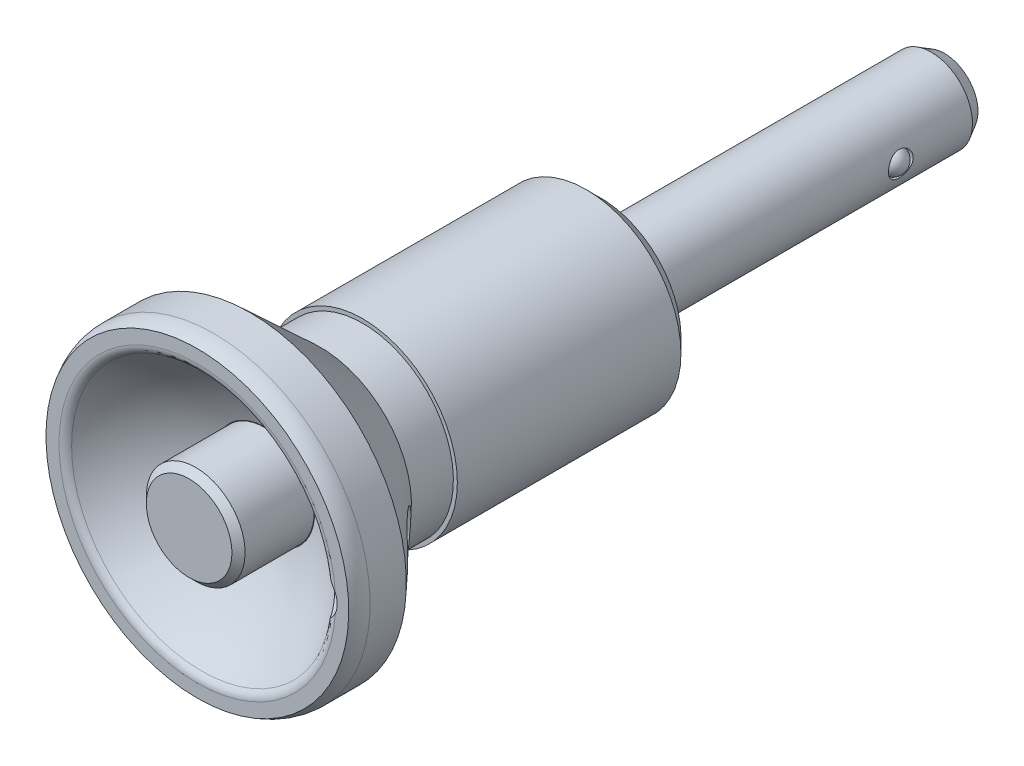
ISO-10303-21;
HEADER;
FILE_DESCRIPTION(('STEP AP214'),'2;1');
FILE_NAME('part.step','',(''),(''),'','','');
FILE_SCHEMA(('AUTOMOTIVE_DESIGN { 1 0 10303 214 1 1 1 1 }'));
ENDSEC;
DATA;
#1=APPLICATION_CONTEXT('core data for automotive mechanical design processes');
#2=APPLICATION_PROTOCOL_DEFINITION('international standard','automotive_design',2000,#1);
#3=PRODUCT_CONTEXT('',#1,'mechanical');
#4=PRODUCT('Part','Part','',(#3));
#5=PRODUCT_RELATED_PRODUCT_CATEGORY('part','',(#4));
#6=PRODUCT_DEFINITION_FORMATION('','',#4);
#7=PRODUCT_DEFINITION_CONTEXT('part definition',#1,'design');
#8=PRODUCT_DEFINITION('design','',#6,#7);
#9=PRODUCT_DEFINITION_SHAPE('','',#8);
#10=(LENGTH_UNIT() NAMED_UNIT(*) SI_UNIT(.MILLI.,.METRE.));
#11=(NAMED_UNIT(*) PLANE_ANGLE_UNIT() SI_UNIT($,.RADIAN.));
#12=(NAMED_UNIT(*) SI_UNIT($,.STERADIAN.) SOLID_ANGLE_UNIT());
#13=UNCERTAINTY_MEASURE_WITH_UNIT(LENGTH_MEASURE(1.E-05),#10,'distance_accuracy_value','');
#14=(GEOMETRIC_REPRESENTATION_CONTEXT(3) GLOBAL_UNCERTAINTY_ASSIGNED_CONTEXT((#13)) GLOBAL_UNIT_ASSIGNED_CONTEXT((#10,
#11,#12)) REPRESENTATION_CONTEXT('',''));
#15=CARTESIAN_POINT('',(0.,0.,0.));
#16=DIRECTION('',(0.,0.,1.));
#17=DIRECTION('',(1.,0.,0.));
#18=AXIS2_PLACEMENT_3D('',#15,#16,#17);
#19=CARTESIAN_POINT('',(0.,0.,-20.9));
#20=DIRECTION('',(0.,0.,-1.));
#21=DIRECTION('',(0.,1.,0.));
#22=AXIS2_PLACEMENT_3D('',#19,#20,#21);
#23=CYLINDRICAL_SURFACE('',#22,1.25);
#24=CARTESIAN_POINT('',(0.,0.,-20.9));
#25=DIRECTION('',(0.,0.,-1.));
#26=DIRECTION('',(0.,1.,0.));
#27=AXIS2_PLACEMENT_3D('',#24,#25,#26);
#28=CIRCLE('',#27,1.25);
#29=CARTESIAN_POINT('',(0.,1.25,-20.9));
#30=VERTEX_POINT('',#29);
#31=EDGE_CURVE('E137',#30,#30,#28,.T.);
#32=ORIENTED_EDGE('',*,*,#31,.T.);
#33=EDGE_LOOP('',(#32));
#34=FACE_BOUND('',#33,.T.);
#35=CARTESIAN_POINT('',(0.,0.,-16.9));
#36=DIRECTION('',(0.,0.,1.));
#37=DIRECTION('',(0.,-1.,0.));
#38=AXIS2_PLACEMENT_3D('',#35,#36,#37);
#39=CIRCLE('',#38,1.25);
#40=CARTESIAN_POINT('',(0.,-1.25,-16.9));
#41=VERTEX_POINT('',#40);
#42=EDGE_CURVE('E73',#41,#41,#39,.T.);
#43=ORIENTED_EDGE('',*,*,#42,.T.);
#44=EDGE_LOOP('',(#43));
#45=FACE_BOUND('',#44,.T.);
#46=ADVANCED_FACE('F14',(#34,#45),#23,.F.);
#47=CARTESIAN_POINT('',(3.5,0.,-15.75));
#48=DIRECTION('',(1.,0.,0.));
#49=DIRECTION('',(0.,1.,0.));
#50=AXIS2_PLACEMENT_3D('',#47,#48,#49);
#51=CYLINDRICAL_SURFACE('',#50,0.75);
#52=CARTESIAN_POINT('',(2.38484800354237,0.75,-15.75));
#53=CARTESIAN_POINT('',(2.38484842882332,0.749999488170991,-15.7910972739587));
#54=CARTESIAN_POINT('',(2.38592195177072,0.746610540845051,-15.8321996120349));
#55=CARTESIAN_POINT('',(2.39008289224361,0.733179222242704,-15.9132026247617));
#56=CARTESIAN_POINT('',(2.39317098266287,0.72313462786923,-15.9531028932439));
#57=CARTESIAN_POINT('',(2.40098051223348,0.696763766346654,-16.0305173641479));
#58=CARTESIAN_POINT('',(2.40569923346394,0.680447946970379,-16.0680354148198));
#59=CARTESIAN_POINT('',(2.41623466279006,0.642032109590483,-16.1398109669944));
#60=CARTESIAN_POINT('',(2.42205153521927,0.619931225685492,-16.1740679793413));
#61=CARTESIAN_POINT('',(2.43433431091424,0.569823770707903,-16.2394331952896));
#62=CARTESIAN_POINT('',(2.44081404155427,0.541666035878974,-16.2704229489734));
#63=CARTESIAN_POINT('',(2.4535743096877,0.480568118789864,-16.327318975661));
#64=CARTESIAN_POINT('',(2.45985482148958,0.44762732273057,-16.3532245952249));
#65=CARTESIAN_POINT('',(2.47166607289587,0.377055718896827,-16.3997313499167));
#66=CARTESIAN_POINT('',(2.47717862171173,0.339342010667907,-16.4202117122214));
#67=CARTESIAN_POINT('',(2.48667217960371,0.260812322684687,-16.4544936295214));
#68=CARTESIAN_POINT('',(2.49065351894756,0.219997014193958,-16.4682966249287));
#69=CARTESIAN_POINT('',(2.49653823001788,0.137661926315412,-16.4884400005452));
#70=CARTESIAN_POINT('',(2.49849778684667,0.0961956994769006,-16.4949825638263));
#71=CARTESIAN_POINT('',(2.50031600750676,0.0127109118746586,-16.5010586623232));
#72=CARTESIAN_POINT('',(2.5001751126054,-0.0293075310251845,-16.500593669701));
#73=CARTESIAN_POINT('',(2.49784801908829,-0.11128557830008,-16.4928035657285));
#74=CARTESIAN_POINT('',(2.49572710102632,-0.151268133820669,-16.4856974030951));
#75=CARTESIAN_POINT('',(2.48975761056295,-0.229444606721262,-16.4651843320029));
#76=CARTESIAN_POINT('',(2.48590892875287,-0.267638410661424,-16.4517770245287));
#77=CARTESIAN_POINT('',(2.47682610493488,-0.341673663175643,-16.4188939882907));
#78=CARTESIAN_POINT('',(2.47157634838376,-0.377482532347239,-16.3993493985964));
#79=CARTESIAN_POINT('',(2.46024820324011,-0.445382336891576,-16.3548010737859));
#80=CARTESIAN_POINT('',(2.45416961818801,-0.477472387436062,-16.3297960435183));
#81=CARTESIAN_POINT('',(2.44155775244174,-0.5383302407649,-16.2739011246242));
#82=CARTESIAN_POINT('',(2.43501597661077,-0.566922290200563,-16.2428215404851));
#83=CARTESIAN_POINT('',(2.42241989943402,-0.618538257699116,-16.176244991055));
#84=CARTESIAN_POINT('',(2.41636564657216,-0.641561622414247,-16.1407475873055));
#85=CARTESIAN_POINT('',(2.40538951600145,-0.681569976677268,-16.0658802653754));
#86=CARTESIAN_POINT('',(2.40047905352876,-0.698494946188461,-16.0264764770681));
#87=CARTESIAN_POINT('',(2.39248196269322,-0.725416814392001,-15.9451963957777));
#88=CARTESIAN_POINT('',(2.38939473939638,-0.735415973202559,-15.9033209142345));
#89=CARTESIAN_POINT('',(2.38552424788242,-0.747873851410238,-15.8199588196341));
#90=CARTESIAN_POINT('',(2.38465939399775,-0.75059973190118,-15.7785158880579));
#91=CARTESIAN_POINT('',(2.38510596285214,-0.749179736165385,-15.6957635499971));
#92=CARTESIAN_POINT('',(2.38641708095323,-0.745034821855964,-15.6544541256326));
#93=CARTESIAN_POINT('',(2.390987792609,-0.730228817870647,-15.5742558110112));
#94=CARTESIAN_POINT('',(2.39419588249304,-0.719739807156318,-15.5353319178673));
#95=CARTESIAN_POINT('',(2.40214570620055,-0.69274288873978,-15.4597991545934));
#96=CARTESIAN_POINT('',(2.40688767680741,-0.67623405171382,-15.42319064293));
#97=CARTESIAN_POINT('',(2.41752917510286,-0.637159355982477,-15.3522412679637));
#98=CARTESIAN_POINT('',(2.42345635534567,-0.614442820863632,-15.317987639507));
#99=CARTESIAN_POINT('',(2.43574102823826,-0.563776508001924,-15.2536809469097));
#100=CARTESIAN_POINT('',(2.44209862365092,-0.535825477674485,-15.2236288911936));
#101=CARTESIAN_POINT('',(2.45481816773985,-0.4742275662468,-15.1674097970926));
#102=CARTESIAN_POINT('',(2.46117122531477,-0.440405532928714,-15.1414321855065));
#103=CARTESIAN_POINT('',(2.4729242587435,-0.36873089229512,-15.0955166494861));
#104=CARTESIAN_POINT('',(2.47832428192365,-0.330878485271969,-15.0755784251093));
#105=CARTESIAN_POINT('',(2.48752985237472,-0.25246775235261,-15.0424999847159));
#106=CARTESIAN_POINT('',(2.49134726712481,-0.21193231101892,-15.0293089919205));
#107=CARTESIAN_POINT('',(2.49700989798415,-0.129084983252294,-15.0099695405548));
#108=CARTESIAN_POINT('',(2.4988556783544,-0.0867736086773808,-15.0038190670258));
#109=CARTESIAN_POINT('',(2.50033272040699,-0.00332607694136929,-14.9988884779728));
#110=CARTESIAN_POINT('',(2.50004652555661,0.0377925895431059,-14.9998336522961));
#111=CARTESIAN_POINT('',(2.49748632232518,0.119259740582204,-15.0084108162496));
#112=CARTESIAN_POINT('',(2.49521242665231,0.159608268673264,-15.0160424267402));
#113=CARTESIAN_POINT('',(2.48895584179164,0.237967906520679,-15.0376058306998));
#114=CARTESIAN_POINT('',(2.48499176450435,0.275999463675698,-15.0514690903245));
#115=CARTESIAN_POINT('',(2.47576471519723,0.349216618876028,-15.0850409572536));
#116=CARTESIAN_POINT('',(2.47050152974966,0.38440174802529,-15.1047505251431));
#117=CARTESIAN_POINT('',(2.45901982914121,0.45215094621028,-15.150186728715));
#118=CARTESIAN_POINT('',(2.45277613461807,0.484595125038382,-15.1760857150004));
#119=CARTESIAN_POINT('',(2.44011768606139,0.544768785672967,-15.2328551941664));
#120=CARTESIAN_POINT('',(2.43370288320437,0.572496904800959,-15.2637271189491));
#121=CARTESIAN_POINT('',(2.42120340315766,0.623281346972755,-15.3306703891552));
#122=CARTESIAN_POINT('',(2.41513426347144,0.646173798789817,-15.3668692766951));
#123=CARTESIAN_POINT('',(2.40426273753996,0.685521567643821,-15.4427775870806));
#124=CARTESIAN_POINT('',(2.3994597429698,0.70197997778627,-15.4824853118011));
#125=CARTESIAN_POINT('',(2.39213908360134,0.726509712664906,-15.5598702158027));
#126=CARTESIAN_POINT('',(2.38943077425,0.735294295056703,-15.5973043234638));
#127=CARTESIAN_POINT('',(2.38578521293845,0.747039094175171,-15.6731576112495));
#128=CARTESIAN_POINT('',(2.38484760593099,0.750000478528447,-15.7115765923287));
#129=CARTESIAN_POINT('',(2.38484800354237,0.75,-15.75));
#130=B_SPLINE_CURVE_WITH_KNOTS('',3,(#52,#53,#54,#55,#56,#57,#58,#59,#60,#61,#62,#63,#64,#65,
#66,#67,#68,#69,#70,#71,#72,#73,#74,#75,#76,#77,#78,#79,#80,#81,#82,#83,#84,#85,#86,#87,#88,#89,
#90,#91,#92,#93,#94,#95,#96,#97,#98,#99,#100,#101,#102,#103,#104,#105,#106,#107,#108,#109,#110,
#111,#112,#113,#114,#115,#116,#117,#118,#119,#120,#121,#122,#123,#124,#125,#126,#127,#128,#129),
.UNSPECIFIED.,.T.,.F.,(4,2,2,2,2,2,2,2,2,2,2,2,2,2,2,2,2,2,2,2,2,2,2,2,2,2,2,2,2,2,2,2,2,2,2,2,
2,2,4),(0.,0.123150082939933,0.246341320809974,0.369328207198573,0.492333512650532,
0.618865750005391,0.745414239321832,0.874579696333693,1.00371727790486,1.12916070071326,
1.25457777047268,1.37600062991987,1.49743117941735,1.62027604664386,1.74315008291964,
1.87076073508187,1.99838406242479,2.12723119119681,2.25603625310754,2.38004040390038,
2.50402719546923,2.62479297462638,2.74557740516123,2.86960365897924,2.99365962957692,
3.12239753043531,3.2511290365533,3.37887695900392,3.5065883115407,3.62938151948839,
3.75216776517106,3.87363548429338,3.99512317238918,4.12049813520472,4.24590926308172,
4.375058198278,4.50414496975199,4.61930576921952,4.73444347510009),.UNSPECIFIED.);
#131=CARTESIAN_POINT('',(2.38484800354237,0.75,-15.75));
#132=VERTEX_POINT('',#131);
#133=EDGE_CURVE('E472',#132,#132,#130,.T.);
#134=ORIENTED_EDGE('',*,*,#133,.F.);
#135=EDGE_LOOP('',(#134));
#136=FACE_BOUND('',#135,.T.);
#137=CARTESIAN_POINT('',(2.12206555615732,0.,-16.5));
#138=CARTESIAN_POINT('',(2.12206552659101,0.0420016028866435,-16.4999980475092));
#139=CARTESIAN_POINT('',(2.12177655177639,0.0840371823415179,-16.4964593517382));
#140=CARTESIAN_POINT('',(2.12061587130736,0.166953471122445,-16.4823928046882));
#141=CARTESIAN_POINT('',(2.11974338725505,0.207832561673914,-16.4718556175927));
#142=CARTESIAN_POINT('',(2.11740251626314,0.28721580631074,-16.444098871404));
#143=CARTESIAN_POINT('',(2.11593446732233,0.325721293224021,-16.4268831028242));
#144=CARTESIAN_POINT('',(2.11237724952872,0.399276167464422,-16.3862728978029));
#145=CARTESIAN_POINT('',(2.11028825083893,0.434326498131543,-16.3628801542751));
#146=CARTESIAN_POINT('',(2.10543833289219,0.500027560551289,-16.3105688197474));
#147=CARTESIAN_POINT('',(2.10267678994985,0.530674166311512,-16.2816451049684));
#148=CARTESIAN_POINT('',(2.09639815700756,0.586669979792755,-16.219125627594));
#149=CARTESIAN_POINT('',(2.092881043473,0.612019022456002,-16.1855297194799));
#150=CARTESIAN_POINT('',(2.08489768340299,0.656755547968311,-16.1146022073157));
#151=CARTESIAN_POINT('',(2.0804297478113,0.67613226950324,-16.0772640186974));
#152=CARTESIAN_POINT('',(2.07020296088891,0.708344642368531,-15.999991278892));
#153=CARTESIAN_POINT('',(2.0644438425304,0.721178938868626,-15.9600561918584));
#154=CARTESIAN_POINT('',(2.05389778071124,0.735194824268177,-15.8996910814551));
#155=CARTESIAN_POINT('',(2.05010571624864,0.738983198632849,-15.8796691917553));
#156=CARTESIAN_POINT('',(2.04141297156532,0.74488576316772,-15.8397229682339));
#157=CARTESIAN_POINT('',(2.03651754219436,0.747007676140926,-15.8197986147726));
#158=CARTESIAN_POINT('',(2.02684555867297,0.748972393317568,-15.790414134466));
#159=CARTESIAN_POINT('',(2.02323558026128,0.749424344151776,-15.7807072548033));
#160=CARTESIAN_POINT('',(2.01701848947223,0.749752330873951,-15.7694169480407));
#161=CARTESIAN_POINT('',(2.0156749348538,0.749806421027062,-15.767179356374));
#162=CARTESIAN_POINT('',(2.01268052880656,0.749891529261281,-15.7629215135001));
#163=CARTESIAN_POINT('',(2.01103259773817,0.749922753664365,-15.7608994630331));
#164=CARTESIAN_POINT('',(2.0084776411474,0.74995123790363,-15.758574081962));
#165=CARTESIAN_POINT('',(2.00780452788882,0.74995728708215,-15.7580205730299));
#166=CARTESIAN_POINT('',(2.00638639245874,0.749967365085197,-15.7570139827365));
#167=CARTESIAN_POINT('',(2.00564151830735,0.749971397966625,-15.7565607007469));
#168=CARTESIAN_POINT('',(2.00429958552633,0.74997677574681,-15.7559086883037));
#169=CARTESIAN_POINT('',(2.00372014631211,0.749978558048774,-15.7556742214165));
#170=CARTESIAN_POINT('',(2.00253072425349,0.74998127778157,-15.7553026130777));
#171=CARTESIAN_POINT('',(2.00192078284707,0.749982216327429,-15.755165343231));
#172=CARTESIAN_POINT('',(2.00068118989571,0.749983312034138,-15.7550039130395));
#173=CARTESIAN_POINT('',(2.0000514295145,0.749983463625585,-15.754980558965));
#174=CARTESIAN_POINT('',(1.99879872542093,0.749982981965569,-15.7550524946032));
#175=CARTESIAN_POINT('',(1.99817578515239,0.749982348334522,-15.7551478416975));
#176=CARTESIAN_POINT('',(1.99687877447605,0.74998011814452,-15.7554634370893));
#177=CARTESIAN_POINT('',(1.99620827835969,0.749978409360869,-15.7556980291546));
#178=CARTESIAN_POINT('',(1.99491412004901,0.749973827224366,-15.7562722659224));
#179=CARTESIAN_POINT('',(1.99429055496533,0.749970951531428,-15.756612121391));
#180=CARTESIAN_POINT('',(1.99269674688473,0.749961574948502,-15.757617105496));
#181=CARTESIAN_POINT('',(1.99176918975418,0.749953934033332,-15.7583489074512));
#182=CARTESIAN_POINT('',(1.99002713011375,0.749934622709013,-15.759935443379));
#183=CARTESIAN_POINT('',(1.98921298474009,0.74992293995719,-15.7607905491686));
#184=CARTESIAN_POINT('',(1.9861138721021,0.749867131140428,-15.7643633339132));
#185=CARTESIAN_POINT('',(1.98416699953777,0.749805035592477,-15.767365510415));
#186=CARTESIAN_POINT('',(1.98064972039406,0.749635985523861,-15.7735811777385));
#187=CARTESIAN_POINT('',(1.97908220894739,0.749528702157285,-15.776796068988));
#188=CARTESIAN_POINT('',(1.97118573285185,0.748823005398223,-15.7943323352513));
#189=CARTESIAN_POINT('',(1.96669087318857,0.747791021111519,-15.8094291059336));
#190=CARTESIAN_POINT('',(1.9587074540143,0.744776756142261,-15.8397066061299));
#191=CARTESIAN_POINT('',(1.95522081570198,0.742792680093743,-15.8548874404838));
#192=CARTESIAN_POINT('',(1.94374396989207,0.733930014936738,-15.9094467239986));
#193=CARTESIAN_POINT('',(1.93743955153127,0.724291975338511,-15.9488040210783));
#194=CARTESIAN_POINT('',(1.92627183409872,0.698725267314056,-16.0255607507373));
#195=CARTESIAN_POINT('',(1.92140902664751,0.682794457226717,-16.0629595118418));
#196=CARTESIAN_POINT('',(1.91269378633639,0.644884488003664,-16.1350867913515));
#197=CARTESIAN_POINT('',(1.90884957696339,0.622858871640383,-16.169792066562));
#198=CARTESIAN_POINT('',(1.9019443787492,0.57339517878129,-16.2351809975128));
#199=CARTESIAN_POINT('',(1.89888335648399,0.545957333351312,-16.2658648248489));
#200=CARTESIAN_POINT('',(1.89337289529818,0.485652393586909,-16.3230715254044));
#201=CARTESIAN_POINT('',(1.89094062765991,0.452666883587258,-16.3494714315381));
#202=CARTESIAN_POINT('',(1.88672141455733,0.382705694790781,-16.3963827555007));
#203=CARTESIAN_POINT('',(1.88493451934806,0.345729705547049,-16.4168937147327));
#204=CARTESIAN_POINT('',(1.88197364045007,0.268898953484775,-16.4514014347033));
#205=CARTESIAN_POINT('',(1.88079872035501,0.229048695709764,-16.4654081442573));
#206=CARTESIAN_POINT('',(1.87903847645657,0.147552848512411,-16.4865461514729));
#207=CARTESIAN_POINT('',(1.87845313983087,0.105907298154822,-16.4936775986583));
#208=CARTESIAN_POINT('',(1.87786418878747,0.0220644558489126,-16.5008535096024));
#209=CARTESIAN_POINT('',(1.87785976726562,-0.0201319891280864,-16.5009078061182));
#210=CARTESIAN_POINT('',(1.87843054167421,-0.103934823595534,-16.4939525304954));
#211=CARTESIAN_POINT('',(1.87900573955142,-0.145541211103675,-16.4869429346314));
#212=CARTESIAN_POINT('',(1.88074362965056,-0.226969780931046,-16.4660662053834));
#213=CARTESIAN_POINT('',(1.88190614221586,-0.26679250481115,-16.4522011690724));
#214=CARTESIAN_POINT('',(1.88483707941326,-0.343537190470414,-16.4180169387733));
#215=CARTESIAN_POINT('',(1.88660547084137,-0.38045931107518,-16.3976980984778));
#216=CARTESIAN_POINT('',(1.89078474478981,-0.450386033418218,-16.3511798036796));
#217=CARTESIAN_POINT('',(1.89319605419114,-0.483388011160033,-16.3249764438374));
#218=CARTESIAN_POINT('',(1.89872480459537,-0.544528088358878,-16.2674467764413));
#219=CARTESIAN_POINT('',(1.90184247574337,-0.572664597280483,-16.2361188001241));
#220=CARTESIAN_POINT('',(1.90891559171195,-0.623332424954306,-16.1691939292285));
#221=CARTESIAN_POINT('',(1.91287294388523,-0.645850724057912,-16.1335873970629));
#222=CARTESIAN_POINT('',(1.92185974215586,-0.684556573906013,-16.059244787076));
#223=CARTESIAN_POINT('',(1.92688769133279,-0.700752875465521,-16.0205131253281));
#224=CARTESIAN_POINT('',(1.93569998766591,-0.719912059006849,-15.9613088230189));
#225=CARTESIAN_POINT('',(1.93882374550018,-0.725422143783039,-15.9415275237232));
#226=CARTESIAN_POINT('',(1.94572571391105,-0.734783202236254,-15.9016930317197));
#227=CARTESIAN_POINT('',(1.94950340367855,-0.738635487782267,-15.8816400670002));
#228=CARTESIAN_POINT('',(1.95814565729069,-0.744662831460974,-15.8415775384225));
#229=CARTESIAN_POINT('',(1.96300736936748,-0.746842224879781,-15.8215679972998));
#230=CARTESIAN_POINT('',(1.97256849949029,-0.748884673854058,-15.7920280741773));
#231=CARTESIAN_POINT('',(1.97613548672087,-0.749360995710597,-15.7822567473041));
#232=CARTESIAN_POINT('',(1.98218536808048,-0.749715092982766,-15.7708069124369));
#233=CARTESIAN_POINT('',(1.98348487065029,-0.749774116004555,-15.7685398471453));
#234=CARTESIAN_POINT('',(1.98636386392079,-0.74986881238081,-15.7641876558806));
#235=CARTESIAN_POINT('',(1.98794184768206,-0.749904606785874,-15.7621016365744));
#236=CARTESIAN_POINT('',(1.99047765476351,-0.749940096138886,-15.759509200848));
#237=CARTESIAN_POINT('',(1.99123387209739,-0.749948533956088,-15.7588100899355));
#238=CARTESIAN_POINT('',(1.99284087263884,-0.749962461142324,-15.7575302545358));
#239=CARTESIAN_POINT('',(1.99369132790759,-0.74996796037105,-15.7569491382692));
#240=CARTESIAN_POINT('',(1.99514970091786,-0.749974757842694,-15.7561608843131));
#241=CARTESIAN_POINT('',(1.99572587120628,-0.749976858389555,-15.7558957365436));
#242=CARTESIAN_POINT('',(1.99691288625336,-0.749980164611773,-15.7554589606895));
#243=CARTESIAN_POINT('',(1.99752368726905,-0.74998137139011,-15.7552872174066));
#244=CARTESIAN_POINT('',(1.99877257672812,-0.749982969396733,-15.755055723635));
#245=CARTESIAN_POINT('',(1.99941086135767,-0.749983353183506,-15.7549969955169));
#246=CARTESIAN_POINT('',(2.00068685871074,-0.749983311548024,-15.7550032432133));
#247=CARTESIAN_POINT('',(2.0013245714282,-0.749982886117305,-15.7550682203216));
#248=CARTESIAN_POINT('',(2.00250998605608,-0.749981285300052,-15.7552992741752));
#249=CARTESIAN_POINT('',(2.00306003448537,-0.749980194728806,-15.7554538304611));
#250=CARTESIAN_POINT('',(2.00413225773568,-0.749977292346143,-15.7558393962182));
#251=CARTESIAN_POINT('',(2.00465441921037,-0.749975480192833,-15.7560704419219));
#252=CARTESIAN_POINT('',(2.00604384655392,-0.749969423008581,-15.7567872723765));
#253=CARTESIAN_POINT('',(2.00687904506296,-0.749964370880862,-15.7573347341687));
#254=CARTESIAN_POINT('',(2.00845949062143,-0.749951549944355,-15.7585470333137));
#255=CARTESIAN_POINT('',(2.00920439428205,-0.749943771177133,-15.7592122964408));
#256=CARTESIAN_POINT('',(2.01179340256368,-0.749909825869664,-15.7617738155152));
#257=CARTESIAN_POINT('',(2.01341810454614,-0.749874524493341,-15.7638864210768));
#258=CARTESIAN_POINT('',(2.01637599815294,-0.749779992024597,-15.7683057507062));
#259=CARTESIAN_POINT('',(2.01770709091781,-0.749720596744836,-15.7706137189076));
#260=CARTESIAN_POINT('',(2.02386184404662,-0.749364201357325,-15.782208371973));
#261=CARTESIAN_POINT('',(2.02747600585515,-0.748881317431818,-15.7921055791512));
#262=CARTESIAN_POINT('',(2.03390293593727,-0.747496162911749,-15.812079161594));
#263=CARTESIAN_POINT('',(2.03671325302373,-0.746592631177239,-15.8221559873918));
#264=CARTESIAN_POINT('',(2.04854756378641,-0.74149822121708,-15.8682211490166));
#265=CARTESIAN_POINT('',(2.05509857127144,-0.734806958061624,-15.9046218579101));
#266=CARTESIAN_POINT('',(2.06668346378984,-0.716059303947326,-15.9761498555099));
#267=CARTESIAN_POINT('',(2.07171700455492,-0.704001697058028,-16.0112768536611));
#268=CARTESIAN_POINT('',(2.08068762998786,-0.674801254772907,-16.0794028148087));
#269=CARTESIAN_POINT('',(2.08462795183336,-0.65767375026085,-16.1124078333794));
#270=CARTESIAN_POINT('',(2.09177764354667,-0.618687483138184,-16.1755655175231));
#271=CARTESIAN_POINT('',(2.09498703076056,-0.596828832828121,-16.2057182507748));
#272=CARTESIAN_POINT('',(2.10116735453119,-0.545719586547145,-16.2661901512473));
#273=CARTESIAN_POINT('',(2.10405302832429,-0.515877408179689,-16.2960211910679));
#274=CARTESIAN_POINT('',(2.10914374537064,-0.451566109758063,-16.3503003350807));
#275=CARTESIAN_POINT('',(2.11134835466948,-0.417094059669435,-16.3747450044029));
#276=CARTESIAN_POINT('',(2.11512569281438,-0.344521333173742,-16.4175173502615));
#277=CARTESIAN_POINT('',(2.11669850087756,-0.306421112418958,-16.4358457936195));
#278=CARTESIAN_POINT('',(2.11924053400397,-0.227705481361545,-16.4658349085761));
#279=CARTESIAN_POINT('',(2.12021060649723,-0.187093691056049,-16.477504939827));
#280=CARTESIAN_POINT('',(2.12128084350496,-0.121823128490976,-16.4904453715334));
#281=CARTESIAN_POINT('',(2.12157516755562,-0.0976020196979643,-16.494024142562));
#282=CARTESIAN_POINT('',(2.12196753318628,-0.0489244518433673,-16.4988020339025));
#283=CARTESIAN_POINT('',(2.12206557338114,-0.0244679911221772,-16.5000011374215));
#284=CARTESIAN_POINT('',(2.12206555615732,0.,-16.5));
#285=B_SPLINE_CURVE_WITH_KNOTS('',3,(#137,#138,#139,#140,#141,#142,#143,#144,#145,#146,#147,
#148,#149,#150,#151,#152,#153,#154,#155,#156,#157,#158,#159,#160,#161,#162,#163,#164,#165,#166,
#167,#168,#169,#170,#171,#172,#173,#174,#175,#176,#177,#178,#179,#180,#181,#182,#183,#184,#185,
#186,#187,#188,#189,#190,#191,#192,#193,#194,#195,#196,#197,#198,#199,#200,#201,#202,#203,#204,
#205,#206,#207,#208,#209,#210,#211,#212,#213,#214,#215,#216,#217,#218,#219,#220,#221,#222,#223,
#224,#225,#226,#227,#228,#229,#230,#231,#232,#233,#234,#235,#236,#237,#238,#239,#240,#241,#242,
#243,#244,#245,#246,#247,#248,#249,#250,#251,#252,#253,#254,#255,#256,#257,#258,#259,#260,#261,
#262,#263,#264,#265,#266,#267,#268,#269,#270,#271,#272,#273,#274,#275,#276,#277,#278,#279,#280,
#281,#282,#283,#284),.UNSPECIFIED.,.T.,.F.,(4,2,2,2,2,2,2,2,2,2,2,2,2,2,2,2,2,2,2,2,2,2,2,2,2,2,
2,2,2,2,2,2,2,2,2,2,2,2,2,2,2,2,2,2,2,2,2,2,2,2,2,2,2,2,2,2,2,2,2,2,2,2,2,2,2,2,2,2,2,2,2,2,2,
4),(0.,0.125915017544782,0.251998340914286,0.378010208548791,0.503987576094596,
0.630082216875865,0.756180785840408,0.882505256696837,1.00885587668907,1.07095509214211,
1.13276479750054,1.16364176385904,1.17146560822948,1.17921795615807,1.18182645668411,
1.18442968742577,1.18629815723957,1.18816415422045,1.19004333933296,1.19192343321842,
1.19404265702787,1.19616615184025,1.19969056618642,1.20322583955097,1.21387723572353,
1.22460752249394,1.27164281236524,1.3187671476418,1.44104687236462,1.56336824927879,
1.68664899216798,1.80992447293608,1.93627677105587,2.06263890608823,2.18880711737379,
2.31497258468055,2.44096276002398,2.56695335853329,2.69290544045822,2.81885062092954,
2.94487963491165,3.07094977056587,3.19730940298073,3.32349350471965,3.3857459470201,
3.44794903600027,3.5099903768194,3.54103548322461,3.54886944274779,3.55666224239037,
3.55974510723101,3.56281756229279,3.56471411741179,3.56660832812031,3.56851959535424,
3.57043088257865,3.57213834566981,3.57384661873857,3.57682501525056,3.5798144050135,
3.58774744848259,3.59573548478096,3.62715703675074,3.65867340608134,3.77072612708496,
3.88280425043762,3.9945468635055,4.10628682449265,4.23255563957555,4.35890474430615,
4.48523800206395,4.61139323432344,4.68474438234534,4.75809604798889),.UNSPECIFIED.);
#286=CARTESIAN_POINT('',(1.98517452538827,-0.749829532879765,-15.7659897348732));
#287=VERTEX_POINT('',#286);
#288=CARTESIAN_POINT('',(1.98517452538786,0.749829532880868,-15.7659897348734));
#289=VERTEX_POINT('',#288);
#290=EDGE_CURVE('E32',#287,#289,#285,.T.);
#291=ORIENTED_EDGE('',*,*,#290,.F.);
#292=CARTESIAN_POINT('',(1.98511012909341,0.75,-15.75));
#293=CARTESIAN_POINT('',(1.98510947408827,0.750000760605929,-15.7906891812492));
#294=CARTESIAN_POINT('',(1.98637478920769,0.746677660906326,-15.8313730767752));
#295=CARTESIAN_POINT('',(1.99126881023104,0.733525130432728,-15.9115254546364));
#296=CARTESIAN_POINT('',(1.99489767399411,0.723695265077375,-15.9509938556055));
#297=CARTESIAN_POINT('',(2.00405749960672,0.697925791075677,-16.027538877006));
#298=CARTESIAN_POINT('',(2.00958434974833,0.681999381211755,-16.0646204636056));
#299=CARTESIAN_POINT('',(2.02191113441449,0.644534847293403,-16.1355987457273));
#300=CARTESIAN_POINT('',(2.02871140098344,0.622995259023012,-16.1694946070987));
#301=CARTESIAN_POINT('',(2.04315464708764,0.573899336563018,-16.2346325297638));
#302=CARTESIAN_POINT('',(2.05082046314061,0.546136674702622,-16.2657140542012));
#303=CARTESIAN_POINT('',(2.06593925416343,0.485821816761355,-16.3228913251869));
#304=CARTESIAN_POINT('',(2.07339218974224,0.45326874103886,-16.3489861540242));
#305=CARTESIAN_POINT('',(2.08751316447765,0.383102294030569,-16.396198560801));
#306=CARTESIAN_POINT('',(2.09415125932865,0.345367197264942,-16.4171449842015));
#307=CARTESIAN_POINT('',(2.10562302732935,0.266633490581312,-16.4523276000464));
#308=CARTESIAN_POINT('',(2.11045725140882,0.225635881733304,-16.4665658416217));
#309=CARTESIAN_POINT('',(2.11761468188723,0.143226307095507,-16.4873748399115));
#310=CARTESIAN_POINT('',(2.12002790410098,0.101891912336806,-16.4942212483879));
#311=CARTESIAN_POINT('',(2.12239260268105,0.0185951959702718,-16.5009318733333));
#312=CARTESIAN_POINT('',(2.12234479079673,-0.0233669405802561,-16.5007981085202));
#313=CARTESIAN_POINT('',(2.1198520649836,-0.104765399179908,-16.4937203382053));
#314=CARTESIAN_POINT('',(2.11751277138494,-0.144231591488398,-16.4870763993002));
#315=CARTESIAN_POINT('',(2.11083531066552,-0.221447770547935,-16.4676670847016));
#316=CARTESIAN_POINT('',(2.10649700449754,-0.259197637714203,-16.4549012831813));
#317=CARTESIAN_POINT('',(2.09618170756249,-0.332529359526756,-16.4234526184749));
#318=CARTESIAN_POINT('',(2.09018277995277,-0.368073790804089,-16.4046899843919));
#319=CARTESIAN_POINT('',(2.07716261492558,-0.435593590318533,-16.3618481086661));
#320=CARTESIAN_POINT('',(2.07014107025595,-0.467567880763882,-16.3377672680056));
#321=CARTESIAN_POINT('',(2.05537310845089,-0.528817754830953,-16.2834909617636));
#322=CARTESIAN_POINT('',(2.04760798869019,-0.557863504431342,-16.2530408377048));
#323=CARTESIAN_POINT('',(2.03253136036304,-0.610516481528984,-16.187644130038));
#324=CARTESIAN_POINT('',(2.02521994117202,-0.634122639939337,-16.1526966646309));
#325=CARTESIAN_POINT('',(2.01176867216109,-0.675599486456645,-16.0784862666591));
#326=CARTESIAN_POINT('',(2.00565194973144,-0.693360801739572,-16.0391576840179));
#327=CARTESIAN_POINT('',(1.99554932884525,-0.721926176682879,-15.9577958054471));
#328=CARTESIAN_POINT('',(1.99156240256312,-0.732733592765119,-15.9157638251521));
#329=CARTESIAN_POINT('',(1.98640793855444,-0.746590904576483,-15.8324370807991));
#330=CARTESIAN_POINT('',(1.98510948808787,-0.750001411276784,-15.7912104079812));
#331=CARTESIAN_POINT('',(1.98511077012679,-0.749998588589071,-15.7087622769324));
#332=CARTESIAN_POINT('',(1.98640995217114,-0.746586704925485,-15.6675408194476));
#333=CARTESIAN_POINT('',(1.99132841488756,-0.73336148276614,-15.5880087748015));
#334=CARTESIAN_POINT('',(1.99485212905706,-0.723811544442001,-15.5496478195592));
#335=CARTESIAN_POINT('',(2.00371360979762,-0.698904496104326,-15.4750848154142));
#336=CARTESIAN_POINT('',(2.00905172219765,-0.683546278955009,-15.4388831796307));
#337=CARTESIAN_POINT('',(2.02116838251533,-0.646857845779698,-15.3682772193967));
#338=CARTESIAN_POINT('',(2.02799034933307,-0.625339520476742,-15.3339783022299));
#339=CARTESIAN_POINT('',(2.0422272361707,-0.577148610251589,-15.2693487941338));
#340=CARTESIAN_POINT('',(2.049642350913,-0.550474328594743,-15.2390195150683));
#341=CARTESIAN_POINT('',(2.06472450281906,-0.49098465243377,-15.1814583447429));
#342=CARTESIAN_POINT('',(2.07238288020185,-0.457911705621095,-15.1544895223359));
#343=CARTESIAN_POINT('',(2.08669071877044,-0.387520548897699,-15.1064607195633));
#344=CARTESIAN_POINT('',(2.09334020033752,-0.350202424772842,-15.085400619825));
#345=CARTESIAN_POINT('',(2.10486052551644,-0.272501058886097,-15.04996007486));
#346=CARTESIAN_POINT('',(2.10974080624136,-0.232135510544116,-15.0355440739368));
#347=CARTESIAN_POINT('',(2.11721112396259,-0.149343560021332,-15.0137754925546));
#348=CARTESIAN_POINT('',(2.11980210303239,-0.106918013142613,-15.0064200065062));
#349=CARTESIAN_POINT('',(2.1223221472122,-0.0236025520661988,-14.9992676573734));
#350=CARTESIAN_POINT('',(2.12238350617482,0.0172514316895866,-14.9990951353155));
#351=CARTESIAN_POINT('',(2.12017213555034,0.0983795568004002,-15.0053683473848));
#352=CARTESIAN_POINT('',(2.11789963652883,0.138653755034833,-15.0118134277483));
#353=CARTESIAN_POINT('',(2.11133034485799,0.216681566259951,-15.0308817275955));
#354=CARTESIAN_POINT('',(2.10707427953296,0.25446919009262,-15.0433808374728));
#355=CARTESIAN_POINT('',(2.09697770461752,0.327420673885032,-15.0740837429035));
#356=CARTESIAN_POINT('',(2.09113689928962,0.362584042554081,-15.0922886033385));
#357=CARTESIAN_POINT('',(2.07817677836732,0.430810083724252,-15.1347117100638));
#358=CARTESIAN_POINT('',(2.07101599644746,0.463734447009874,-15.1591395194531));
#359=CARTESIAN_POINT('',(2.05630552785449,0.525136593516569,-15.2129712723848));
#360=CARTESIAN_POINT('',(2.04875571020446,0.553612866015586,-15.2423768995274));
#361=CARTESIAN_POINT('',(2.03370376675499,0.606635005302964,-15.3069242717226));
#362=CARTESIAN_POINT('',(2.02621942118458,0.63094326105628,-15.3422660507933));
#363=CARTESIAN_POINT('',(2.01255226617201,0.673269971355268,-15.4167698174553));
#364=CARTESIAN_POINT('',(2.00636932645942,0.691289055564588,-15.4559314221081));
#365=CARTESIAN_POINT('',(1.996117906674,0.720357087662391,-15.5368652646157));
#366=CARTESIAN_POINT('',(1.9920414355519,0.731432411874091,-15.5786269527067));
#367=CARTESIAN_POINT('',(1.98653852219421,0.746251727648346,-15.6635948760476));
#368=CARTESIAN_POINT('',(1.98511082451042,0.749999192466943,-15.706800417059));
#369=CARTESIAN_POINT('',(1.98511012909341,0.75,-15.75));
#370=B_SPLINE_CURVE_WITH_KNOTS('',3,(#292,#293,#294,#295,#296,#297,#298,#299,#300,#301,#302,
#303,#304,#305,#306,#307,#308,#309,#310,#311,#312,#313,#314,#315,#316,#317,#318,#319,#320,#321,
#322,#323,#324,#325,#326,#327,#328,#329,#330,#331,#332,#333,#334,#335,#336,#337,#338,#339,#340,
#341,#342,#343,#344,#345,#346,#347,#348,#349,#350,#351,#352,#353,#354,#355,#356,#357,#358,#359,
#360,#361,#362,#363,#364,#365,#366,#367,#368,#369),.UNSPECIFIED.,.T.,.F.,(4,2,2,2,2,2,2,2,2,2,2,
2,2,2,2,2,2,2,2,2,2,2,2,2,2,2,2,2,2,2,2,2,2,2,2,2,2,2,4),(0.,0.121907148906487,
0.243822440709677,0.365475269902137,0.487159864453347,0.613715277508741,0.740293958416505,
0.870638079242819,1.00094235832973,1.1261990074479,1.25141943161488,1.3711272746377,
1.49084344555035,1.61222346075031,1.73364002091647,1.86143140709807,1.98924788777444,
2.11933565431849,2.24936058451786,2.37288906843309,2.49639137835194,2.61491875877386,
2.73346874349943,2.85611728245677,2.97880625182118,3.10826153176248,3.23771419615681,
3.36646581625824,3.49516442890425,3.61712333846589,3.73907020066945,3.85861662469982,
3.97818537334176,4.10248855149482,4.22683385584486,4.35683352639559,4.48682017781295,
4.61631002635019,4.7457384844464),.UNSPECIFIED.);
#371=EDGE_CURVE('E68',#287,#289,#370,.T.);
#372=ORIENTED_EDGE('',*,*,#371,.T.);
#373=EDGE_LOOP('',(#291,#372));
#374=FACE_BOUND('',#373,.T.);
#375=ADVANCED_FACE('F72',(#136,#374),#51,.F.);
#376=CARTESIAN_POINT('',(-2.38484800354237,0.75,-15.75));
#377=CARTESIAN_POINT('',(-2.38484842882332,0.74999948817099,-15.7089027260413));
#378=CARTESIAN_POINT('',(-2.38592195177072,0.746610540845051,-15.6678003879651));
#379=CARTESIAN_POINT('',(-2.39008289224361,0.733179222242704,-15.5867973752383));
#380=CARTESIAN_POINT('',(-2.39317098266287,0.72313462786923,-15.5468971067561));
#381=CARTESIAN_POINT('',(-2.40098051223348,0.696763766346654,-15.4694826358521));
#382=CARTESIAN_POINT('',(-2.40569923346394,0.680447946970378,-15.4319645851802));
#383=CARTESIAN_POINT('',(-2.41623466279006,0.642032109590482,-15.3601890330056));
#384=CARTESIAN_POINT('',(-2.42205153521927,0.619931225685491,-15.3259320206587));
#385=CARTESIAN_POINT('',(-2.43433431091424,0.569823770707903,-15.2605668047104));
#386=CARTESIAN_POINT('',(-2.44081404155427,0.541666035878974,-15.2295770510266));
#387=CARTESIAN_POINT('',(-2.4535743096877,0.480568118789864,-15.172681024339));
#388=CARTESIAN_POINT('',(-2.45985482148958,0.447627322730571,-15.1467754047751));
#389=CARTESIAN_POINT('',(-2.47166607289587,0.377055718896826,-15.1002686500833));
#390=CARTESIAN_POINT('',(-2.47717862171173,0.339342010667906,-15.0797882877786));
#391=CARTESIAN_POINT('',(-2.48667217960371,0.260812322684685,-15.0455063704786));
#392=CARTESIAN_POINT('',(-2.49065351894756,0.219997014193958,-15.0317033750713));
#393=CARTESIAN_POINT('',(-2.49653823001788,0.137661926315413,-15.0115599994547));
#394=CARTESIAN_POINT('',(-2.49849778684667,0.0961956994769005,-15.0050174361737));
#395=CARTESIAN_POINT('',(-2.50031600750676,0.0127109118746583,-14.9989413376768));
#396=CARTESIAN_POINT('',(-2.5001751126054,-0.0293075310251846,-14.999406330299));
#397=CARTESIAN_POINT('',(-2.49784801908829,-0.11128557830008,-15.0071964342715));
#398=CARTESIAN_POINT('',(-2.49572710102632,-0.151268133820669,-15.0143025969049));
#399=CARTESIAN_POINT('',(-2.48975761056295,-0.229444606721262,-15.0348156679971));
#400=CARTESIAN_POINT('',(-2.48590892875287,-0.267638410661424,-15.0482229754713));
#401=CARTESIAN_POINT('',(-2.47682610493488,-0.341673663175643,-15.0811060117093));
#402=CARTESIAN_POINT('',(-2.47157634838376,-0.37748253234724,-15.1006506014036));
#403=CARTESIAN_POINT('',(-2.46024820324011,-0.445382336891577,-15.1451989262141));
#404=CARTESIAN_POINT('',(-2.45416961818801,-0.477472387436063,-15.1702039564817));
#405=CARTESIAN_POINT('',(-2.44155775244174,-0.5383302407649,-15.2260988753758));
#406=CARTESIAN_POINT('',(-2.43501597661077,-0.566922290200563,-15.2571784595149));
#407=CARTESIAN_POINT('',(-2.42241989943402,-0.618538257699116,-15.323755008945));
#408=CARTESIAN_POINT('',(-2.41636564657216,-0.641561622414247,-15.3592524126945));
#409=CARTESIAN_POINT('',(-2.40538951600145,-0.681569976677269,-15.4341197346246));
#410=CARTESIAN_POINT('',(-2.40047905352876,-0.698494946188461,-15.4735235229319));
#411=CARTESIAN_POINT('',(-2.39248196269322,-0.725416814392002,-15.5548036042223));
#412=CARTESIAN_POINT('',(-2.38939473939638,-0.735415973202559,-15.5966790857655));
#413=CARTESIAN_POINT('',(-2.38552424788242,-0.747873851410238,-15.6800411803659));
#414=CARTESIAN_POINT('',(-2.38465939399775,-0.75059973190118,-15.7214841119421));
#415=CARTESIAN_POINT('',(-2.38510596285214,-0.749179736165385,-15.8042364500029));
#416=CARTESIAN_POINT('',(-2.38641708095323,-0.745034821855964,-15.8455458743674));
#417=CARTESIAN_POINT('',(-2.390987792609,-0.730228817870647,-15.9257441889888));
#418=CARTESIAN_POINT('',(-2.39419588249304,-0.719739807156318,-15.9646680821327));
#419=CARTESIAN_POINT('',(-2.40214570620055,-0.69274288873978,-16.0402008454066));
#420=CARTESIAN_POINT('',(-2.40688767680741,-0.67623405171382,-16.07680935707));
#421=CARTESIAN_POINT('',(-2.41752917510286,-0.637159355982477,-16.1477587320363));
#422=CARTESIAN_POINT('',(-2.42345635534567,-0.614442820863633,-16.182012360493));
#423=CARTESIAN_POINT('',(-2.43574102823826,-0.563776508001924,-16.2463190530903));
#424=CARTESIAN_POINT('',(-2.44209862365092,-0.535825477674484,-16.2763711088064));
#425=CARTESIAN_POINT('',(-2.45481816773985,-0.474227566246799,-16.3325902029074));
#426=CARTESIAN_POINT('',(-2.46117122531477,-0.440405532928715,-16.3585678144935));
#427=CARTESIAN_POINT('',(-2.4729242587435,-0.368730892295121,-16.4044833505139));
#428=CARTESIAN_POINT('',(-2.47832428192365,-0.330878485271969,-16.4244215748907));
#429=CARTESIAN_POINT('',(-2.48752985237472,-0.25246775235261,-16.4575000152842));
#430=CARTESIAN_POINT('',(-2.49134726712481,-0.21193231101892,-16.4706910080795));
#431=CARTESIAN_POINT('',(-2.49700989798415,-0.129084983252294,-16.4900304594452));
#432=CARTESIAN_POINT('',(-2.4988556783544,-0.0867736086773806,-16.4961809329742));
#433=CARTESIAN_POINT('',(-2.50033272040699,-0.00332607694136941,-16.5011115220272));
#434=CARTESIAN_POINT('',(-2.50004652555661,0.0377925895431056,-16.5001663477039));
#435=CARTESIAN_POINT('',(-2.49748632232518,0.119259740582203,-16.4915891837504));
#436=CARTESIAN_POINT('',(-2.49521242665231,0.159608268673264,-16.4839575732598));
#437=CARTESIAN_POINT('',(-2.48895584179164,0.237967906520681,-16.4623941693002));
#438=CARTESIAN_POINT('',(-2.48499176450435,0.2759994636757,-16.4485309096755));
#439=CARTESIAN_POINT('',(-2.47576471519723,0.34921661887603,-16.4149590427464));
#440=CARTESIAN_POINT('',(-2.47050152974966,0.384401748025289,-16.3952494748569));
#441=CARTESIAN_POINT('',(-2.45901982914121,0.452150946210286,-16.349813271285));
#442=CARTESIAN_POINT('',(-2.45277613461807,0.484595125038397,-16.3239142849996));
#443=CARTESIAN_POINT('',(-2.44011768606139,0.544768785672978,-16.2671448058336));
#444=CARTESIAN_POINT('',(-2.43370288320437,0.572496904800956,-16.2362728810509));
#445=CARTESIAN_POINT('',(-2.42120340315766,0.623281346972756,-16.1693296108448));
#446=CARTESIAN_POINT('',(-2.41513426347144,0.646173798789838,-16.1331307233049));
#447=CARTESIAN_POINT('',(-2.40426273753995,0.685521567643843,-16.0572224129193));
#448=CARTESIAN_POINT('',(-2.39945974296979,0.701979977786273,-16.0175146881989));
#449=CARTESIAN_POINT('',(-2.39213908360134,0.7265097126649,-15.9401297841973));
#450=CARTESIAN_POINT('',(-2.38943077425,0.735294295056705,-15.9026956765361));
#451=CARTESIAN_POINT('',(-2.38578521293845,0.747039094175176,-15.8268423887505));
#452=CARTESIAN_POINT('',(-2.38484760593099,0.750000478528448,-15.7884234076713));
#453=CARTESIAN_POINT('',(-2.38484800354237,0.75,-15.75));
#454=B_SPLINE_CURVE_WITH_KNOTS('',3,(#376,#377,#378,#379,#380,#381,#382,#383,#384,#385,#386,
#387,#388,#389,#390,#391,#392,#393,#394,#395,#396,#397,#398,#399,#400,#401,#402,#403,#404,#405,
#406,#407,#408,#409,#410,#411,#412,#413,#414,#415,#416,#417,#418,#419,#420,#421,#422,#423,#424,
#425,#426,#427,#428,#429,#430,#431,#432,#433,#434,#435,#436,#437,#438,#439,#440,#441,#442,#443,
#444,#445,#446,#447,#448,#449,#450,#451,#452,#453),.UNSPECIFIED.,.T.,.F.,(4,2,2,2,2,2,2,2,2,2,2,
2,2,2,2,2,2,2,2,2,2,2,2,2,2,2,2,2,2,2,2,2,2,2,2,2,2,2,4),(0.,0.123150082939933,
0.246341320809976,0.369328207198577,0.492333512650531,0.618865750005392,0.745414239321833,
0.874579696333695,1.00371727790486,1.12916070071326,1.25457777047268,1.37600062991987,
1.49743117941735,1.62027604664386,1.74315008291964,1.87076073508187,1.99838406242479,
2.12723119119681,2.25603625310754,2.38004040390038,2.50402719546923,2.62479297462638,
2.74557740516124,2.86960365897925,2.99365962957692,3.12239753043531,3.2511290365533,
3.37887695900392,3.5065883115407,3.62938151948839,3.75216776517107,3.87363548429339,
3.99512317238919,4.12049813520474,4.24590926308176,4.37505819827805,4.50414496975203,
4.61930576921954,4.73444347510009),.UNSPECIFIED.);
#455=CARTESIAN_POINT('',(-2.38484800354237,0.75,-15.75));
#456=VERTEX_POINT('',#455);
#457=EDGE_CURVE('E93',#456,#456,#454,.T.);
#458=ORIENTED_EDGE('',*,*,#457,.F.);
#459=EDGE_LOOP('',(#458));
#460=FACE_BOUND('',#459,.T.);
#461=CARTESIAN_POINT('',(-2.12206555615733,0.,-16.5));
#462=CARTESIAN_POINT('',(-2.12206552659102,-0.0420016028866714,-16.4999980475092));
#463=CARTESIAN_POINT('',(-2.12177655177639,-0.084037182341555,-16.4964593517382));
#464=CARTESIAN_POINT('',(-2.12061587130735,-0.166953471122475,-16.4823928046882));
#465=CARTESIAN_POINT('',(-2.11974338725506,-0.207832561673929,-16.4718556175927));
#466=CARTESIAN_POINT('',(-2.11740251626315,-0.287215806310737,-16.444098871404));
#467=CARTESIAN_POINT('',(-2.11593446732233,-0.325721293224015,-16.4268831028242));
#468=CARTESIAN_POINT('',(-2.11237724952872,-0.399276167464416,-16.3862728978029));
#469=CARTESIAN_POINT('',(-2.11028825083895,-0.434326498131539,-16.3628801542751));
#470=CARTESIAN_POINT('',(-2.1054383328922,-0.500027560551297,-16.3105688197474));
#471=CARTESIAN_POINT('',(-2.10267678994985,-0.530674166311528,-16.2816451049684));
#472=CARTESIAN_POINT('',(-2.09639815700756,-0.586669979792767,-16.2191256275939));
#473=CARTESIAN_POINT('',(-2.09288104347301,-0.612019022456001,-16.1855297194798));
#474=CARTESIAN_POINT('',(-2.08489768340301,-0.656755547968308,-16.1146022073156));
#475=CARTESIAN_POINT('',(-2.08042974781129,-0.676132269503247,-16.0772640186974));
#476=CARTESIAN_POINT('',(-2.07020296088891,-0.708344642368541,-15.999991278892));
#477=CARTESIAN_POINT('',(-2.06444384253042,-0.721178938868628,-15.9600561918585));
#478=CARTESIAN_POINT('',(-2.05389778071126,-0.735194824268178,-15.8996910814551));
#479=CARTESIAN_POINT('',(-2.05010571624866,-0.738983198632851,-15.8796691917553));
#480=CARTESIAN_POINT('',(-2.0414129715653,-0.744885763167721,-15.8397229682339));
#481=CARTESIAN_POINT('',(-2.03651754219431,-0.747007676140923,-15.8197986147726));
#482=CARTESIAN_POINT('',(-2.02684555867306,-0.748972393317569,-15.7904141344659));
#483=CARTESIAN_POINT('',(-2.02323558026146,-0.74942434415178,-15.7807072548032));
#484=CARTESIAN_POINT('',(-2.01701848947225,-0.749752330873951,-15.7694169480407));
#485=CARTESIAN_POINT('',(-2.01567493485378,-0.749806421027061,-15.767179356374));
#486=CARTESIAN_POINT('',(-2.01268052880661,-0.749891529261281,-15.7629215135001));
#487=CARTESIAN_POINT('',(-2.01103259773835,-0.749922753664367,-15.7608994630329));
#488=CARTESIAN_POINT('',(-2.00847764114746,-0.749951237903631,-15.758574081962));
#489=CARTESIAN_POINT('',(-2.00780452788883,-0.74995728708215,-15.7580205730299));
#490=CARTESIAN_POINT('',(-2.00638639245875,-0.749967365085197,-15.7570139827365));
#491=CARTESIAN_POINT('',(-2.00564151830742,-0.749971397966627,-15.7565607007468));
#492=CARTESIAN_POINT('',(-2.00429958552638,-0.74997677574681,-15.7559086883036));
#493=CARTESIAN_POINT('',(-2.00372014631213,-0.749978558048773,-15.7556742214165));
#494=CARTESIAN_POINT('',(-2.0025307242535,-0.74998127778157,-15.7553026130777));
#495=CARTESIAN_POINT('',(-2.0019207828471,-0.74998221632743,-15.7551653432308));
#496=CARTESIAN_POINT('',(-2.00068118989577,-0.749983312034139,-15.7550039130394));
#497=CARTESIAN_POINT('',(-2.00005142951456,-0.749983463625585,-15.754980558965));
#498=CARTESIAN_POINT('',(-1.99879872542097,-0.749982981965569,-15.7550524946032));
#499=CARTESIAN_POINT('',(-1.99817578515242,-0.749982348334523,-15.7551478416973));
#500=CARTESIAN_POINT('',(-1.9968787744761,-0.749980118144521,-15.7554634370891));
#501=CARTESIAN_POINT('',(-1.99620827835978,-0.749978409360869,-15.7556980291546));
#502=CARTESIAN_POINT('',(-1.9949141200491,-0.749973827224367,-15.7562722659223));
#503=CARTESIAN_POINT('',(-1.99429055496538,-0.749970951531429,-15.7566121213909));
#504=CARTESIAN_POINT('',(-1.99269674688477,-0.749961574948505,-15.7576171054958));
#505=CARTESIAN_POINT('',(-1.99176918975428,-0.749953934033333,-15.7583489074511));
#506=CARTESIAN_POINT('',(-1.99002713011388,-0.749934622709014,-15.7599354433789));
#507=CARTESIAN_POINT('',(-1.98921298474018,-0.749922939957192,-15.7607905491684));
#508=CARTESIAN_POINT('',(-1.98611387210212,-0.749867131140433,-15.7643633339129));
#509=CARTESIAN_POINT('',(-1.98416699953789,-0.749805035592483,-15.7673655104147));
#510=CARTESIAN_POINT('',(-1.98064972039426,-0.749635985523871,-15.7735811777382));
#511=CARTESIAN_POINT('',(-1.97908220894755,-0.749528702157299,-15.7767960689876));
#512=CARTESIAN_POINT('',(-1.97118573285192,-0.748823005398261,-15.7943323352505));
#513=CARTESIAN_POINT('',(-1.96669087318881,-0.747791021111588,-15.8094291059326));
#514=CARTESIAN_POINT('',(-1.95870745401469,-0.744776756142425,-15.8397066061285));
#515=CARTESIAN_POINT('',(-1.95522081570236,-0.742792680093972,-15.8548874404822));
#516=CARTESIAN_POINT('',(-1.94374396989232,-0.733930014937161,-15.9094467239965));
#517=CARTESIAN_POINT('',(-1.93743955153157,-0.724291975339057,-15.9488040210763));
#518=CARTESIAN_POINT('',(-1.92627183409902,-0.698725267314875,-16.0255607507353));
#519=CARTESIAN_POINT('',(-1.92140902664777,-0.682794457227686,-16.0629595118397));
#520=CARTESIAN_POINT('',(-1.91269378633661,-0.644884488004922,-16.1350867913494));
#521=CARTESIAN_POINT('',(-1.90884957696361,-0.622858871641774,-16.16979206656));
#522=CARTESIAN_POINT('',(-1.9019443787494,-0.57339517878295,-16.2351809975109));
#523=CARTESIAN_POINT('',(-1.89888335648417,-0.545957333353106,-16.265864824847));
#524=CARTESIAN_POINT('',(-1.89337289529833,-0.485652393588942,-16.3230715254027));
#525=CARTESIAN_POINT('',(-1.89094062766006,-0.452666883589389,-16.3494714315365));
#526=CARTESIAN_POINT('',(-1.88672141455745,-0.38270569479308,-16.3963827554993));
#527=CARTESIAN_POINT('',(-1.88493451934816,-0.345729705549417,-16.4168937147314));
#528=CARTESIAN_POINT('',(-1.88197364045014,-0.268898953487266,-16.4514014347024));
#529=CARTESIAN_POINT('',(-1.88079872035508,-0.229048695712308,-16.4654081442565));
#530=CARTESIAN_POINT('',(-1.87903847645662,-0.147552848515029,-16.4865461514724));
#531=CARTESIAN_POINT('',(-1.87845313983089,-0.105907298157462,-16.4936775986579));
#532=CARTESIAN_POINT('',(-1.87786418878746,-0.0220644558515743,-16.5008535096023));
#533=CARTESIAN_POINT('',(-1.87785976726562,0.0201319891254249,-16.5009078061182));
#534=CARTESIAN_POINT('',(-1.87843054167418,0.103934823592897,-16.4939525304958));
#535=CARTESIAN_POINT('',(-1.87900573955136,0.145541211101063,-16.4869429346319));
#536=CARTESIAN_POINT('',(-1.88074362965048,0.226969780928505,-16.4660662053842));
#537=CARTESIAN_POINT('',(-1.88190614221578,0.266792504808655,-16.4522011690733));
#538=CARTESIAN_POINT('',(-1.88483707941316,0.343537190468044,-16.4180169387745));
#539=CARTESIAN_POINT('',(-1.88660547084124,0.38045931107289,-16.3976980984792));
#540=CARTESIAN_POINT('',(-1.89078474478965,0.450386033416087,-16.3511798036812));
#541=CARTESIAN_POINT('',(-1.89319605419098,0.483388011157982,-16.3249764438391));
#542=CARTESIAN_POINT('',(-1.89872480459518,0.544528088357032,-16.2674467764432));
#543=CARTESIAN_POINT('',(-1.90184247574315,0.572664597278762,-16.2361188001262));
#544=CARTESIAN_POINT('',(-1.9089155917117,0.623332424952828,-16.1691939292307));
#545=CARTESIAN_POINT('',(-1.91287294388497,0.645850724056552,-16.1335873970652));
#546=CARTESIAN_POINT('',(-1.92185974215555,0.684556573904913,-16.0592447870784));
#547=CARTESIAN_POINT('',(-1.92688769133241,0.700752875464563,-16.0205131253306));
#548=CARTESIAN_POINT('',(-1.9356999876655,0.719912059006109,-15.9613088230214));
#549=CARTESIAN_POINT('',(-1.93882374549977,0.725422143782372,-15.9415275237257));
#550=CARTESIAN_POINT('',(-1.94572571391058,0.734783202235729,-15.9016930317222));
#551=CARTESIAN_POINT('',(-1.949503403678,0.738635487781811,-15.8816400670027));
#552=CARTESIAN_POINT('',(-1.95814565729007,0.744662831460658,-15.8415775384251));
#553=CARTESIAN_POINT('',(-1.96300736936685,0.746842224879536,-15.8215679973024));
#554=CARTESIAN_POINT('',(-1.97256849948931,0.748884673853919,-15.7920280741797));
#555=CARTESIAN_POINT('',(-1.97613548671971,0.749360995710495,-15.7822567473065));
#556=CARTESIAN_POINT('',(-1.98218536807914,0.749715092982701,-15.7708069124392));
#557=CARTESIAN_POINT('',(-1.9834848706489,0.749774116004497,-15.7685398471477));
#558=CARTESIAN_POINT('',(-1.98636386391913,0.749868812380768,-15.7641876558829));
#559=CARTESIAN_POINT('',(-1.98794184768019,0.74990460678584,-15.7621016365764));
#560=CARTESIAN_POINT('',(-1.99047765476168,0.749940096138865,-15.7595092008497));
#561=CARTESIAN_POINT('',(-1.99123387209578,0.749948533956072,-15.758810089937));
#562=CARTESIAN_POINT('',(-1.99284087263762,0.749962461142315,-15.7575302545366));
#563=CARTESIAN_POINT('',(-1.99369132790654,0.749967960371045,-15.7569491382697));
#564=CARTESIAN_POINT('',(-1.99514970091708,0.749974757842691,-15.7561608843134));
#565=CARTESIAN_POINT('',(-1.99572587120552,0.749976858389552,-15.7558957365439));
#566=CARTESIAN_POINT('',(-1.99691288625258,0.749980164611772,-15.7554589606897));
#567=CARTESIAN_POINT('',(-1.99752368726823,0.749981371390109,-15.7552872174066));
#568=CARTESIAN_POINT('',(-1.99877257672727,0.749982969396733,-15.755055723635));
#569=CARTESIAN_POINT('',(-1.99941086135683,0.749983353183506,-15.754996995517));
#570=CARTESIAN_POINT('',(-2.00068685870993,0.749983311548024,-15.7550032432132));
#571=CARTESIAN_POINT('',(-2.00132457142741,0.749982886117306,-15.7550682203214));
#572=CARTESIAN_POINT('',(-2.00250998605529,0.749981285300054,-15.7552992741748));
#573=CARTESIAN_POINT('',(-2.00306003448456,0.749980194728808,-15.7554538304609));
#574=CARTESIAN_POINT('',(-2.0041322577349,0.749977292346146,-15.7558393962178));
#575=CARTESIAN_POINT('',(-2.00465441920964,0.749975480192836,-15.7560704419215));
#576=CARTESIAN_POINT('',(-2.00604384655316,0.749969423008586,-15.7567872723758));
#577=CARTESIAN_POINT('',(-2.00687904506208,0.749964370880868,-15.7573347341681));
#578=CARTESIAN_POINT('',(-2.00845949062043,0.749951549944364,-15.7585470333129));
#579=CARTESIAN_POINT('',(-2.00920439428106,0.749943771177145,-15.7592122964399));
#580=CARTESIAN_POINT('',(-2.01179340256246,0.749909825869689,-15.7617738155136));
#581=CARTESIAN_POINT('',(-2.01341810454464,0.749874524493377,-15.7638864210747));
#582=CARTESIAN_POINT('',(-2.01637599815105,0.749779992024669,-15.7683057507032));
#583=CARTESIAN_POINT('',(-2.01770709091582,0.749720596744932,-15.770613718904));
#584=CARTESIAN_POINT('',(-2.02386184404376,0.749364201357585,-15.7822083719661));
#585=CARTESIAN_POINT('',(-2.02747600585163,0.74888131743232,-15.7921055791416));
#586=CARTESIAN_POINT('',(-2.03390293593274,0.747496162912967,-15.8120791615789));
#587=CARTESIAN_POINT('',(-2.03671325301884,0.74659263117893,-15.8221559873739));
#588=CARTESIAN_POINT('',(-2.04854756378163,0.741498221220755,-15.8682211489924));
#589=CARTESIAN_POINT('',(-2.05509857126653,0.734806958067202,-15.9046218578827));
#590=CARTESIAN_POINT('',(-2.06668346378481,0.716059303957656,-15.9761498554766));
#591=CARTESIAN_POINT('',(-2.0717170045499,0.70400169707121,-16.0112768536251));
#592=CARTESIAN_POINT('',(-2.08068762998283,0.67480125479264,-16.0794028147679));
#593=CARTESIAN_POINT('',(-2.0846279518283,0.657673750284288,-16.1124078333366));
#594=CARTESIAN_POINT('',(-2.09177764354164,0.618687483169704,-16.175565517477));
#595=CARTESIAN_POINT('',(-2.0949870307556,0.596828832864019,-16.2057182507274));
#596=CARTESIAN_POINT('',(-2.1011673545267,0.545719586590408,-16.2661901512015));
#597=CARTESIAN_POINT('',(-2.10405302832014,0.515877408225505,-16.2960211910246));
#598=CARTESIAN_POINT('',(-2.10914374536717,0.451566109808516,-16.3503003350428));
#599=CARTESIAN_POINT('',(-2.11134835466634,0.417094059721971,-16.3747450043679));
#600=CARTESIAN_POINT('',(-2.11512569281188,0.344521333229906,-16.4175173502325));
#601=CARTESIAN_POINT('',(-2.11669850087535,0.306421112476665,-16.4358457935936));
#602=CARTESIAN_POINT('',(-2.11924053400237,0.227705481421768,-16.465834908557));
#603=CARTESIAN_POINT('',(-2.12021060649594,0.187093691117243,-16.4775049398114));
#604=CARTESIAN_POINT('',(-2.12128084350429,0.121823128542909,-16.4904453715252));
#605=CARTESIAN_POINT('',(-2.1215751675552,0.0976020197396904,-16.4940241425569));
#606=CARTESIAN_POINT('',(-2.12196753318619,0.0489244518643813,-16.4988020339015));
#607=CARTESIAN_POINT('',(-2.12206557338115,0.024467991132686,-16.5000011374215));
#608=CARTESIAN_POINT('',(-2.12206555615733,0.,-16.5));
#609=B_SPLINE_CURVE_WITH_KNOTS('',3,(#461,#462,#463,#464,#465,#466,#467,#468,#469,#470,#471,
#472,#473,#474,#475,#476,#477,#478,#479,#480,#481,#482,#483,#484,#485,#486,#487,#488,#489,#490,
#491,#492,#493,#494,#495,#496,#497,#498,#499,#500,#501,#502,#503,#504,#505,#506,#507,#508,#509,
#510,#511,#512,#513,#514,#515,#516,#517,#518,#519,#520,#521,#522,#523,#524,#525,#526,#527,#528,
#529,#530,#531,#532,#533,#534,#535,#536,#537,#538,#539,#540,#541,#542,#543,#544,#545,#546,#547,
#548,#549,#550,#551,#552,#553,#554,#555,#556,#557,#558,#559,#560,#561,#562,#563,#564,#565,#566,
#567,#568,#569,#570,#571,#572,#573,#574,#575,#576,#577,#578,#579,#580,#581,#582,#583,#584,#585,
#586,#587,#588,#589,#590,#591,#592,#593,#594,#595,#596,#597,#598,#599,#600,#601,#602,#603,#604,
#605,#606,#607,#608),.UNSPECIFIED.,.T.,.F.,(4,2,2,2,2,2,2,2,2,2,2,2,2,2,2,2,2,2,2,2,2,2,2,2,2,2,
2,2,2,2,2,2,2,2,2,2,2,2,2,2,2,2,2,2,2,2,2,2,2,2,2,2,2,2,2,2,2,2,2,2,2,2,2,2,2,2,2,2,2,2,2,2,2,
4),(0.,0.125915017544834,0.251998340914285,0.378010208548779,0.503987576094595,
0.630082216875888,0.756180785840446,0.882505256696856,1.00885587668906,1.07095509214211,
1.13276479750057,1.16364176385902,1.17146560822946,1.17921795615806,1.18182645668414,
1.18442968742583,1.18629815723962,1.18816415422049,1.19004333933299,1.19192343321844,
1.19404265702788,1.19616615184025,1.19969056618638,1.2032258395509,1.21387723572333,
1.22460752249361,1.27164281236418,1.31876714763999,1.44104687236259,1.56336824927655,
1.68664899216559,1.80992447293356,1.93627677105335,2.06263890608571,2.18880711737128,
2.31497258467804,2.44096276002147,2.56695335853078,2.6929054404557,2.81885062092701,
2.94487963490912,3.07094977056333,3.1973094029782,3.32349350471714,3.38574594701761,
3.44794903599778,3.50999037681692,3.5410354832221,3.54886944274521,3.55666224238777,
3.5597451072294,3.56281756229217,3.56471411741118,3.56660832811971,3.56851959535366,
3.57043088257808,3.57213834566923,3.57384661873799,3.57682501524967,3.5798144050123,
3.58774744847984,3.59573548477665,3.62715703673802,3.65867340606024,3.77072612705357,
3.88280425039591,3.99454686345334,4.10628682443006,4.23255563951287,4.3589047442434,
4.48523800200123,4.61139323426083,4.6847443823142,4.75809604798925),.UNSPECIFIED.);
#610=CARTESIAN_POINT('',(-1.98517452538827,0.749829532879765,-15.7659897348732));
#611=VERTEX_POINT('',#610);
#612=CARTESIAN_POINT('',(-1.98517452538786,-0.749829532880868,-15.7659897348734));
#613=VERTEX_POINT('',#612);
#614=EDGE_CURVE('E24',#611,#613,#609,.T.);
#615=ORIENTED_EDGE('',*,*,#614,.F.);
#616=CARTESIAN_POINT('',(-1.98511012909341,0.75,-15.75));
#617=CARTESIAN_POINT('',(-1.98510947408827,0.750000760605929,-15.7093108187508));
#618=CARTESIAN_POINT('',(-1.98637478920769,0.746677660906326,-15.6686269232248));
#619=CARTESIAN_POINT('',(-1.99126881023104,0.733525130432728,-15.5884745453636));
#620=CARTESIAN_POINT('',(-1.99489767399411,0.723695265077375,-15.5490061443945));
#621=CARTESIAN_POINT('',(-2.00405749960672,0.697925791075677,-15.472461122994));
#622=CARTESIAN_POINT('',(-2.00958434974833,0.681999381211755,-15.4353795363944));
#623=CARTESIAN_POINT('',(-2.02191113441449,0.644534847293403,-15.3644012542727));
#624=CARTESIAN_POINT('',(-2.02871140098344,0.622995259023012,-15.3305053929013));
#625=CARTESIAN_POINT('',(-2.04315464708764,0.573899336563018,-15.2653674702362));
#626=CARTESIAN_POINT('',(-2.05082046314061,0.546136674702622,-15.2342859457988));
#627=CARTESIAN_POINT('',(-2.06593925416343,0.485821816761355,-15.1771086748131));
#628=CARTESIAN_POINT('',(-2.07339218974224,0.45326874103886,-15.1510138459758));
#629=CARTESIAN_POINT('',(-2.08751316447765,0.383102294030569,-15.103801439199));
#630=CARTESIAN_POINT('',(-2.09415125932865,0.345367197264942,-15.0828550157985));
#631=CARTESIAN_POINT('',(-2.10562302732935,0.266633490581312,-15.0476723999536));
#632=CARTESIAN_POINT('',(-2.11045725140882,0.225635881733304,-15.0334341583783));
#633=CARTESIAN_POINT('',(-2.11761468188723,0.143226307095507,-15.0126251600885));
#634=CARTESIAN_POINT('',(-2.12002790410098,0.101891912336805,-15.0057787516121));
#635=CARTESIAN_POINT('',(-2.12239260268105,0.0185951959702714,-14.9990681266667));
#636=CARTESIAN_POINT('',(-2.12234479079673,-0.0233669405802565,-14.9992018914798));
#637=CARTESIAN_POINT('',(-2.1198520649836,-0.104765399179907,-15.0062796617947));
#638=CARTESIAN_POINT('',(-2.11751277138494,-0.144231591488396,-15.0129236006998));
#639=CARTESIAN_POINT('',(-2.11083531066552,-0.221447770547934,-15.0323329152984));
#640=CARTESIAN_POINT('',(-2.10649700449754,-0.259197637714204,-15.0450987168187));
#641=CARTESIAN_POINT('',(-2.09618170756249,-0.33252935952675,-15.0765473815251));
#642=CARTESIAN_POINT('',(-2.09018277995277,-0.368073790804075,-15.0953100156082));
#643=CARTESIAN_POINT('',(-2.07716261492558,-0.435593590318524,-15.1381518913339));
#644=CARTESIAN_POINT('',(-2.07014107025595,-0.467567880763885,-15.1622327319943));
#645=CARTESIAN_POINT('',(-2.05537310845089,-0.528817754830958,-15.2165090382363));
#646=CARTESIAN_POINT('',(-2.04760798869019,-0.557863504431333,-15.2469591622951));
#647=CARTESIAN_POINT('',(-2.03253136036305,-0.61051648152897,-15.312355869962));
#648=CARTESIAN_POINT('',(-2.02521994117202,-0.634122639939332,-15.3473033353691));
#649=CARTESIAN_POINT('',(-2.01176867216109,-0.675599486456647,-15.4215137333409));
#650=CARTESIAN_POINT('',(-2.00565194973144,-0.693360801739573,-15.4608423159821));
#651=CARTESIAN_POINT('',(-1.99554932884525,-0.721926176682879,-15.5422041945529));
#652=CARTESIAN_POINT('',(-1.99156240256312,-0.732733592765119,-15.5842361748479));
#653=CARTESIAN_POINT('',(-1.98640793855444,-0.746590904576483,-15.6675629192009));
#654=CARTESIAN_POINT('',(-1.98510948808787,-0.750001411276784,-15.7087895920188));
#655=CARTESIAN_POINT('',(-1.98511077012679,-0.749998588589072,-15.7912377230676));
#656=CARTESIAN_POINT('',(-1.98640995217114,-0.746586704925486,-15.8324591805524));
#657=CARTESIAN_POINT('',(-1.99132841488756,-0.73336148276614,-15.9119912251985));
#658=CARTESIAN_POINT('',(-1.99485212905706,-0.723811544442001,-15.9503521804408));
#659=CARTESIAN_POINT('',(-2.00371360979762,-0.698904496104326,-16.0249151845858));
#660=CARTESIAN_POINT('',(-2.00905172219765,-0.683546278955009,-16.0611168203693));
#661=CARTESIAN_POINT('',(-2.02116838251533,-0.646857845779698,-16.1317227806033));
#662=CARTESIAN_POINT('',(-2.02799034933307,-0.625339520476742,-16.1660216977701));
#663=CARTESIAN_POINT('',(-2.0422272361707,-0.577148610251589,-16.2306512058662));
#664=CARTESIAN_POINT('',(-2.049642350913,-0.550474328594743,-16.2609804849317));
#665=CARTESIAN_POINT('',(-2.06472450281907,-0.490984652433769,-16.3185416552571));
#666=CARTESIAN_POINT('',(-2.07238288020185,-0.457911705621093,-16.3455104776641));
#667=CARTESIAN_POINT('',(-2.08669071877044,-0.387520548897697,-16.3935392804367));
#668=CARTESIAN_POINT('',(-2.09334020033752,-0.350202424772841,-16.414599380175));
#669=CARTESIAN_POINT('',(-2.10486052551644,-0.272501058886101,-16.45003992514));
#670=CARTESIAN_POINT('',(-2.10974080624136,-0.232135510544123,-16.4644559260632));
#671=CARTESIAN_POINT('',(-2.11721112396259,-0.149343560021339,-16.4862245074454));
#672=CARTESIAN_POINT('',(-2.11980210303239,-0.106918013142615,-16.4935799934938));
#673=CARTESIAN_POINT('',(-2.1223221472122,-0.0236025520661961,-16.5007323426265));
#674=CARTESIAN_POINT('',(-2.12238350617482,0.0172514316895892,-16.5009048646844));
#675=CARTESIAN_POINT('',(-2.12017213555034,0.0983795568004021,-16.4946316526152));
#676=CARTESIAN_POINT('',(-2.11789963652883,0.138653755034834,-16.4881865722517));
#677=CARTESIAN_POINT('',(-2.11133034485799,0.21668156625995,-16.4691182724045));
#678=CARTESIAN_POINT('',(-2.10707427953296,0.254469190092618,-16.4566191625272));
#679=CARTESIAN_POINT('',(-2.09697770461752,0.32742067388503,-16.4259162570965));
#680=CARTESIAN_POINT('',(-2.09113689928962,0.362584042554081,-16.4077113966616));
#681=CARTESIAN_POINT('',(-2.07817677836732,0.430810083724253,-16.3652882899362));
#682=CARTESIAN_POINT('',(-2.07101599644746,0.463734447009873,-16.3408604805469));
#683=CARTESIAN_POINT('',(-2.05630552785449,0.525136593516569,-16.2870287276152));
#684=CARTESIAN_POINT('',(-2.04875571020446,0.553612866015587,-16.2576231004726));
#685=CARTESIAN_POINT('',(-2.03370376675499,0.606635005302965,-16.1930757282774));
#686=CARTESIAN_POINT('',(-2.02621942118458,0.630943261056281,-16.1577339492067));
#687=CARTESIAN_POINT('',(-2.01255226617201,0.673269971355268,-16.0832301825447));
#688=CARTESIAN_POINT('',(-2.00636932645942,0.691289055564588,-16.0440685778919));
#689=CARTESIAN_POINT('',(-1.996117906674,0.720357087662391,-15.9631347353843));
#690=CARTESIAN_POINT('',(-1.9920414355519,0.73143241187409,-15.9213730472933));
#691=CARTESIAN_POINT('',(-1.98653852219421,0.746251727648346,-15.8364051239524));
#692=CARTESIAN_POINT('',(-1.98511082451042,0.749999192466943,-15.793199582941));
#693=CARTESIAN_POINT('',(-1.98511012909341,0.75,-15.75));
#694=B_SPLINE_CURVE_WITH_KNOTS('',3,(#616,#617,#618,#619,#620,#621,#622,#623,#624,#625,#626,
#627,#628,#629,#630,#631,#632,#633,#634,#635,#636,#637,#638,#639,#640,#641,#642,#643,#644,#645,
#646,#647,#648,#649,#650,#651,#652,#653,#654,#655,#656,#657,#658,#659,#660,#661,#662,#663,#664,
#665,#666,#667,#668,#669,#670,#671,#672,#673,#674,#675,#676,#677,#678,#679,#680,#681,#682,#683,
#684,#685,#686,#687,#688,#689,#690,#691,#692,#693),.UNSPECIFIED.,.T.,.F.,(4,2,2,2,2,2,2,2,2,2,2,
2,2,2,2,2,2,2,2,2,2,2,2,2,2,2,2,2,2,2,2,2,2,2,2,2,2,2,4),(0.,0.121907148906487,
0.243822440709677,0.365475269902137,0.487159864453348,0.613715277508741,0.740293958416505,
0.87063807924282,1.00094235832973,1.1261990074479,1.25141943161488,1.3711272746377,
1.49084344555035,1.6122234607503,1.73364002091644,1.86143140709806,1.98924788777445,
2.1193356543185,2.24936058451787,2.37288906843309,2.49639137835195,2.61491875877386,
2.73346874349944,2.85611728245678,2.97880625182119,3.10826153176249,3.23771419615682,
3.36646581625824,3.49516442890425,3.61712333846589,3.73907020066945,3.85861662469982,
3.97818537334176,4.10248855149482,4.22683385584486,4.35683352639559,4.48682017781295,
4.61631002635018,4.7457384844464),.UNSPECIFIED.);
#695=EDGE_CURVE('E70',#611,#613,#694,.T.);
#696=ORIENTED_EDGE('',*,*,#695,.T.);
#697=EDGE_LOOP('',(#615,#696));
#698=FACE_BOUND('',#697,.T.);
#699=ADVANCED_FACE('F103',(#460,#698),#51,.F.);
#700=CARTESIAN_POINT('',(2.,0.,-15.76));
#701=DIRECTION('',(0.,0.,-1.));
#702=DIRECTION('',(-1.,0.,0.));
#703=AXIS2_PLACEMENT_3D('',#700,#701,#702);
#704=SPHERICAL_SURFACE('',#703,0.75);
#705=ORIENTED_EDGE('',*,*,#290,.T.);
#706=CARTESIAN_POINT('',(2.122065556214,0.,-15.0199999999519));
#707=CARTESIAN_POINT('',(2.1220661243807,-0.0416995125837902,-15.0199994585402));
#708=CARTESIAN_POINT('',(2.12082597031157,-0.0833931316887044,-15.0233280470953));
#709=CARTESIAN_POINT('',(2.11599628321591,-0.16557692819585,-15.0365592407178));
#710=CARTESIAN_POINT('',(2.11240719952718,-0.206067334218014,-15.0464605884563));
#711=CARTESIAN_POINT('',(2.10325457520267,-0.284691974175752,-15.0725949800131));
#712=CARTESIAN_POINT('',(2.09769183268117,-0.322827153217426,-15.0888254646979));
#713=CARTESIAN_POINT('',(2.08517014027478,-0.395723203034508,-15.1272393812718));
#714=CARTESIAN_POINT('',(2.07821103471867,-0.430483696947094,-15.1494234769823));
#715=CARTESIAN_POINT('',(2.06356417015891,-0.495986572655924,-15.1994434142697));
#716=CARTESIAN_POINT('',(2.0558706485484,-0.526691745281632,-15.2273263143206));
#717=CARTESIAN_POINT('',(2.04064379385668,-0.582911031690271,-15.2879515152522));
#718=CARTESIAN_POINT('',(2.03311046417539,-0.608425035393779,-15.3206939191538));
#719=CARTESIAN_POINT('',(2.01905128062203,-0.653571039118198,-15.3902046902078));
#720=CARTESIAN_POINT('',(2.01252531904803,-0.673203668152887,-15.4269726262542));
#721=CARTESIAN_POINT('',(2.00124424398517,-0.706036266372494,-15.5035296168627));
#722=CARTESIAN_POINT('',(1.9964888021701,-0.719237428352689,-15.5433181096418));
#723=CARTESIAN_POINT('',(1.9894218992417,-0.738557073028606,-15.6236408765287));
#724=CARTESIAN_POINT('',(1.98704780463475,-0.744857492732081,-15.6641258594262));
#725=CARTESIAN_POINT('',(1.98480203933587,-0.750822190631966,-15.7456477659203));
#726=CARTESIAN_POINT('',(1.9849299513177,-0.750487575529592,-15.7866845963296));
#727=CARTESIAN_POINT('',(1.98763628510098,-0.743288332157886,-15.8670389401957));
#728=CARTESIAN_POINT('',(1.99015228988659,-0.736590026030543,-15.9063736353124));
#729=CARTESIAN_POINT('',(1.99726118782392,-0.717088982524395,-15.9833004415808));
#730=CARTESIAN_POINT('',(2.00185415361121,-0.704286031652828,-16.0208924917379));
#731=CARTESIAN_POINT('',(2.01266388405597,-0.672773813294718,-16.0936624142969));
#732=CARTESIAN_POINT('',(2.01889474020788,-0.654012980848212,-16.1288158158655));
#733=CARTESIAN_POINT('',(2.03229445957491,-0.611101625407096,-16.1954631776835));
#734=CARTESIAN_POINT('',(2.0394634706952,-0.586950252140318,-16.22695655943));
#735=CARTESIAN_POINT('',(2.05422900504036,-0.533019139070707,-16.2864677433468));
#736=CARTESIAN_POINT('',(2.0618318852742,-0.5030867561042,-16.314345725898));
#737=CARTESIAN_POINT('',(2.07644287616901,-0.438895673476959,-16.3647699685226));
#738=CARTESIAN_POINT('',(2.08345092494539,-0.404636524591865,-16.3873156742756));
#739=CARTESIAN_POINT('',(2.09624959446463,-0.332081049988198,-16.4268850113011));
#740=CARTESIAN_POINT('',(2.10201772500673,-0.293726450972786,-16.44380925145));
#741=CARTESIAN_POINT('',(2.11156880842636,-0.214542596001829,-16.4711973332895));
#742=CARTESIAN_POINT('',(2.11535185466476,-0.173713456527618,-16.4816614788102));
#743=CARTESIAN_POINT('',(2.12050991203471,-0.0910961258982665,-16.4958175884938));
#744=CARTESIAN_POINT('',(2.12190446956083,-0.0493185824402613,-16.4995645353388));
#745=CARTESIAN_POINT('',(2.12220009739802,0.034307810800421,-16.5003637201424));
#746=CARTESIAN_POINT('',(2.12110130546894,0.0761566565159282,-16.4974163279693));
#747=CARTESIAN_POINT('',(2.11654684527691,0.158336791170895,-16.4849571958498));
#748=CARTESIAN_POINT('',(2.11311287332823,0.198678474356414,-16.4755058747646));
#749=CARTESIAN_POINT('',(2.10426341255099,0.277122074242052,-16.450325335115));
#750=CARTESIAN_POINT('',(2.09884783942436,0.31522389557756,-16.4345958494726));
#751=CARTESIAN_POINT('',(2.0865462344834,0.388427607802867,-16.3970838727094));
#752=CARTESIAN_POINT('',(2.07964956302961,0.423505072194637,-16.3752572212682));
#753=CARTESIAN_POINT('',(2.06513504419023,0.489407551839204,-16.3261097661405));
#754=CARTESIAN_POINT('',(2.05751712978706,0.520232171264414,-16.2987884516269));
#755=CARTESIAN_POINT('',(2.04229898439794,0.577108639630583,-16.238993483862));
#756=CARTESIAN_POINT('',(2.03469973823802,0.603108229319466,-16.2064698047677));
#757=CARTESIAN_POINT('',(2.02045661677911,0.649231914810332,-16.1373031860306));
#758=CARTESIAN_POINT('',(2.01381267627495,0.669356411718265,-16.1006605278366));
#759=CARTESIAN_POINT('',(2.0023365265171,0.702938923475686,-16.0247690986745));
#760=CARTESIAN_POINT('',(1.99748125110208,0.716482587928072,-15.985561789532));
#761=CARTESIAN_POINT('',(1.99003699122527,0.736909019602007,-15.9052441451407));
#762=CARTESIAN_POINT('',(1.98744750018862,0.743793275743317,-15.8641342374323));
#763=CARTESIAN_POINT('',(1.98489051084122,0.750589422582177,-15.7825815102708));
#764=CARTESIAN_POINT('',(1.98484233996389,0.75071583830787,-15.742158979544));
#765=CARTESIAN_POINT('',(1.9871695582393,0.744533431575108,-15.6618828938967));
#766=CARTESIAN_POINT('',(1.98954477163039,0.738225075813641,-15.6220292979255));
#767=CARTESIAN_POINT('',(1.99640639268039,0.719458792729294,-15.5444730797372));
#768=CARTESIAN_POINT('',(2.00086870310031,0.707070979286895,-15.5067512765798));
#769=CARTESIAN_POINT('',(2.01140728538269,0.676507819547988,-15.4339741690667));
#770=CARTESIAN_POINT('',(2.01748374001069,0.658331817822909,-15.3989191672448));
#771=CARTESIAN_POINT('',(2.03076571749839,0.616158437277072,-15.3315572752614));
#772=CARTESIAN_POINT('',(2.03799444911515,0.59203410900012,-15.2993344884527));
#773=CARTESIAN_POINT('',(2.05270594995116,0.538814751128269,-15.2393631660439));
#774=CARTESIAN_POINT('',(2.06018874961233,0.509719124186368,-15.2116151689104));
#775=CARTESIAN_POINT('',(2.07484514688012,0.446389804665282,-15.1605072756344));
#776=CARTESIAN_POINT('',(2.08200382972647,0.412033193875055,-15.1372951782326));
#777=CARTESIAN_POINT('',(2.09501422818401,0.33974406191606,-15.0968216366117));
#778=CARTESIAN_POINT('',(2.10086563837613,0.301810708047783,-15.0795615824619));
#779=CARTESIAN_POINT('',(2.11096915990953,0.220781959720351,-15.0504633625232));
#780=CARTESIAN_POINT('',(2.1150881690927,0.177511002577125,-15.0390649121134));
#781=CARTESIAN_POINT('',(2.12063595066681,0.0894910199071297,-15.0238338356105));
#782=CARTESIAN_POINT('',(2.12206494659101,0.0447421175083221,-15.0200005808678));
#783=CARTESIAN_POINT('',(2.122065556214,0.,-15.0199999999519));
#784=B_SPLINE_CURVE_WITH_KNOTS('',3,(#706,#707,#708,#709,#710,#711,#712,#713,#714,#715,#716,
#717,#718,#719,#720,#721,#722,#723,#724,#725,#726,#727,#728,#729,#730,#731,#732,#733,#734,#735,
#736,#737,#738,#739,#740,#741,#742,#743,#744,#745,#746,#747,#748,#749,#750,#751,#752,#753,#754,
#755,#756,#757,#758,#759,#760,#761,#762,#763,#764,#765,#766,#767,#768,#769,#770,#771,#772,#773,
#774,#775,#776,#777,#778,#779,#780,#781,#782,#783),.UNSPECIFIED.,.T.,.F.,(4,2,2,2,2,2,2,2,2,2,2,
2,2,2,2,2,2,2,2,2,2,2,2,2,2,2,2,2,2,2,2,2,2,2,2,2,2,2,4),(0.,0.12493896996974,0.249854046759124,
0.374718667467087,0.499597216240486,0.625551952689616,0.751509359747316,0.877453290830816,
1.00337385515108,1.12588807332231,1.24838185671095,1.36775973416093,1.48714178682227,
1.60758661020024,1.72805044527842,1.85228878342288,1.97654003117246,2.10288378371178,
2.22922159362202,2.35452047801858,2.47981243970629,2.60395592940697,2.72810470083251,
2.85317706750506,2.97826106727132,3.10462948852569,3.2309892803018,3.35565724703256,
3.48029733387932,3.60097833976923,3.7216505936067,3.84096273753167,3.9602883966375,
4.08242264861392,4.20457158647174,4.33020585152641,4.45586943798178,4.58993572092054,
4.72399086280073),.UNSPECIFIED.);
#785=EDGE_CURVE('E66',#289,#287,#784,.T.);
#786=ORIENTED_EDGE('',*,*,#785,.T.);
#787=EDGE_LOOP('',(#705,#786));
#788=FACE_BOUND('',#787,.T.);
#789=ADVANCED_FACE('F75',(#788),#704,.T.);
#790=CARTESIAN_POINT('',(-2.,0.,-15.76));
#791=DIRECTION('',(0.,0.,1.));
#792=DIRECTION('',(1.,0.,0.));
#793=AXIS2_PLACEMENT_3D('',#790,#791,#792);
#794=SPHERICAL_SURFACE('',#793,0.75);
#795=ORIENTED_EDGE('',*,*,#614,.T.);
#796=CARTESIAN_POINT('',(-2.122065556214,0.,-15.0199999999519));
#797=CARTESIAN_POINT('',(-2.1220661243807,0.0416995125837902,-15.0199994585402));
#798=CARTESIAN_POINT('',(-2.12082597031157,0.0833931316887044,-15.0233280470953));
#799=CARTESIAN_POINT('',(-2.11599628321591,0.16557692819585,-15.0365592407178));
#800=CARTESIAN_POINT('',(-2.11240719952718,0.206067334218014,-15.0464605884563));
#801=CARTESIAN_POINT('',(-2.10325457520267,0.284691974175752,-15.0725949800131));
#802=CARTESIAN_POINT('',(-2.09769183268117,0.322827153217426,-15.0888254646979));
#803=CARTESIAN_POINT('',(-2.08517014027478,0.395723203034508,-15.1272393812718));
#804=CARTESIAN_POINT('',(-2.07821103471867,0.430483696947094,-15.1494234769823));
#805=CARTESIAN_POINT('',(-2.06356417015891,0.495986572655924,-15.1994434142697));
#806=CARTESIAN_POINT('',(-2.0558706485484,0.526691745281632,-15.2273263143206));
#807=CARTESIAN_POINT('',(-2.04064379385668,0.582911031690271,-15.2879515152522));
#808=CARTESIAN_POINT('',(-2.03311046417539,0.608425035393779,-15.3206939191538));
#809=CARTESIAN_POINT('',(-2.01905128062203,0.653571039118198,-15.3902046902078));
#810=CARTESIAN_POINT('',(-2.01252531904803,0.673203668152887,-15.4269726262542));
#811=CARTESIAN_POINT('',(-2.00124424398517,0.706036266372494,-15.5035296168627));
#812=CARTESIAN_POINT('',(-1.9964888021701,0.719237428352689,-15.5433181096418));
#813=CARTESIAN_POINT('',(-1.9894218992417,0.738557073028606,-15.6236408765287));
#814=CARTESIAN_POINT('',(-1.98704780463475,0.744857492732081,-15.6641258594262));
#815=CARTESIAN_POINT('',(-1.98480203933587,0.750822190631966,-15.7456477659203));
#816=CARTESIAN_POINT('',(-1.9849299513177,0.750487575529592,-15.7866845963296));
#817=CARTESIAN_POINT('',(-1.98763628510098,0.743288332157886,-15.8670389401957));
#818=CARTESIAN_POINT('',(-1.99015228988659,0.736590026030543,-15.9063736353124));
#819=CARTESIAN_POINT('',(-1.99726118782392,0.717088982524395,-15.9833004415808));
#820=CARTESIAN_POINT('',(-2.00185415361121,0.704286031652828,-16.0208924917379));
#821=CARTESIAN_POINT('',(-2.01266388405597,0.672773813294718,-16.0936624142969));
#822=CARTESIAN_POINT('',(-2.01889474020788,0.654012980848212,-16.1288158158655));
#823=CARTESIAN_POINT('',(-2.03229445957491,0.611101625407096,-16.1954631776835));
#824=CARTESIAN_POINT('',(-2.0394634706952,0.586950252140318,-16.22695655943));
#825=CARTESIAN_POINT('',(-2.05422900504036,0.533019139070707,-16.2864677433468));
#826=CARTESIAN_POINT('',(-2.0618318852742,0.5030867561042,-16.314345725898));
#827=CARTESIAN_POINT('',(-2.07644287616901,0.438895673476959,-16.3647699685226));
#828=CARTESIAN_POINT('',(-2.08345092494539,0.404636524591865,-16.3873156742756));
#829=CARTESIAN_POINT('',(-2.09624959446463,0.332081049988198,-16.4268850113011));
#830=CARTESIAN_POINT('',(-2.10201772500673,0.293726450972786,-16.44380925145));
#831=CARTESIAN_POINT('',(-2.11156880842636,0.214542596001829,-16.4711973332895));
#832=CARTESIAN_POINT('',(-2.11535185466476,0.173713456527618,-16.4816614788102));
#833=CARTESIAN_POINT('',(-2.12050991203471,0.0910961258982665,-16.4958175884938));
#834=CARTESIAN_POINT('',(-2.12190446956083,0.0493185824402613,-16.4995645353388));
#835=CARTESIAN_POINT('',(-2.12220009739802,-0.034307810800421,-16.5003637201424));
#836=CARTESIAN_POINT('',(-2.12110130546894,-0.0761566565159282,-16.4974163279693));
#837=CARTESIAN_POINT('',(-2.11654684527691,-0.158336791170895,-16.4849571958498));
#838=CARTESIAN_POINT('',(-2.11311287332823,-0.198678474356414,-16.4755058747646));
#839=CARTESIAN_POINT('',(-2.10426341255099,-0.277122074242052,-16.450325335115));
#840=CARTESIAN_POINT('',(-2.09884783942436,-0.31522389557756,-16.4345958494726));
#841=CARTESIAN_POINT('',(-2.0865462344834,-0.388427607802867,-16.3970838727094));
#842=CARTESIAN_POINT('',(-2.07964956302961,-0.423505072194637,-16.3752572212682));
#843=CARTESIAN_POINT('',(-2.06513504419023,-0.489407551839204,-16.3261097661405));
#844=CARTESIAN_POINT('',(-2.05751712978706,-0.520232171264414,-16.2987884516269));
#845=CARTESIAN_POINT('',(-2.04229898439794,-0.577108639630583,-16.238993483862));
#846=CARTESIAN_POINT('',(-2.03469973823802,-0.603108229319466,-16.2064698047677));
#847=CARTESIAN_POINT('',(-2.02045661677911,-0.649231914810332,-16.1373031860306));
#848=CARTESIAN_POINT('',(-2.01381267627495,-0.669356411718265,-16.1006605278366));
#849=CARTESIAN_POINT('',(-2.0023365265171,-0.702938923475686,-16.0247690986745));
#850=CARTESIAN_POINT('',(-1.99748125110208,-0.716482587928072,-15.985561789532));
#851=CARTESIAN_POINT('',(-1.99003699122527,-0.736909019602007,-15.9052441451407));
#852=CARTESIAN_POINT('',(-1.98744750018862,-0.743793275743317,-15.8641342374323));
#853=CARTESIAN_POINT('',(-1.98489051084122,-0.750589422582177,-15.7825815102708));
#854=CARTESIAN_POINT('',(-1.98484233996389,-0.75071583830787,-15.742158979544));
#855=CARTESIAN_POINT('',(-1.9871695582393,-0.744533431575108,-15.6618828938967));
#856=CARTESIAN_POINT('',(-1.98954477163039,-0.738225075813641,-15.6220292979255));
#857=CARTESIAN_POINT('',(-1.99640639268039,-0.719458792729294,-15.5444730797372));
#858=CARTESIAN_POINT('',(-2.00086870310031,-0.707070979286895,-15.5067512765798));
#859=CARTESIAN_POINT('',(-2.01140728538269,-0.676507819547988,-15.4339741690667));
#860=CARTESIAN_POINT('',(-2.01748374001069,-0.658331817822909,-15.3989191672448));
#861=CARTESIAN_POINT('',(-2.03076571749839,-0.616158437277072,-15.3315572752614));
#862=CARTESIAN_POINT('',(-2.03799444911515,-0.59203410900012,-15.2993344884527));
#863=CARTESIAN_POINT('',(-2.05270594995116,-0.538814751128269,-15.2393631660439));
#864=CARTESIAN_POINT('',(-2.06018874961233,-0.509719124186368,-15.2116151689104));
#865=CARTESIAN_POINT('',(-2.07484514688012,-0.446389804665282,-15.1605072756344));
#866=CARTESIAN_POINT('',(-2.08200382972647,-0.412033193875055,-15.1372951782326));
#867=CARTESIAN_POINT('',(-2.09501422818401,-0.33974406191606,-15.0968216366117));
#868=CARTESIAN_POINT('',(-2.10086563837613,-0.301810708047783,-15.0795615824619));
#869=CARTESIAN_POINT('',(-2.11096915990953,-0.220781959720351,-15.0504633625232));
#870=CARTESIAN_POINT('',(-2.1150881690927,-0.177511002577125,-15.0390649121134));
#871=CARTESIAN_POINT('',(-2.12063595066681,-0.0894910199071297,-15.0238338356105));
#872=CARTESIAN_POINT('',(-2.12206494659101,-0.0447421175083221,-15.0200005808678));
#873=CARTESIAN_POINT('',(-2.122065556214,0.,-15.0199999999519));
#874=B_SPLINE_CURVE_WITH_KNOTS('',3,(#796,#797,#798,#799,#800,#801,#802,#803,#804,#805,#806,
#807,#808,#809,#810,#811,#812,#813,#814,#815,#816,#817,#818,#819,#820,#821,#822,#823,#824,#825,
#826,#827,#828,#829,#830,#831,#832,#833,#834,#835,#836,#837,#838,#839,#840,#841,#842,#843,#844,
#845,#846,#847,#848,#849,#850,#851,#852,#853,#854,#855,#856,#857,#858,#859,#860,#861,#862,#863,
#864,#865,#866,#867,#868,#869,#870,#871,#872,#873),.UNSPECIFIED.,.T.,.F.,(4,2,2,2,2,2,2,2,2,2,2,
2,2,2,2,2,2,2,2,2,2,2,2,2,2,2,2,2,2,2,2,2,2,2,2,2,2,2,4),(0.,0.12493896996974,0.249854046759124,
0.374718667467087,0.499597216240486,0.625551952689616,0.751509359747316,0.877453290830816,
1.00337385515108,1.12588807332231,1.24838185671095,1.36775973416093,1.48714178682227,
1.60758661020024,1.72805044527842,1.85228878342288,1.97654003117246,2.10288378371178,
2.22922159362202,2.35452047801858,2.47981243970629,2.60395592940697,2.72810470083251,
2.85317706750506,2.97826106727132,3.10462948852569,3.2309892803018,3.35565724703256,
3.48029733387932,3.60097833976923,3.7216505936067,3.84096273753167,3.9602883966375,
4.08242264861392,4.20457158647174,4.33020585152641,4.45586943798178,4.58993572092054,
4.72399086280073),.UNSPECIFIED.);
#875=EDGE_CURVE('E9',#613,#611,#874,.T.);
#876=ORIENTED_EDGE('',*,*,#875,.T.);
#877=EDGE_LOOP('',(#795,#876));
#878=FACE_BOUND('',#877,.T.);
#879=ADVANCED_FACE('F102',(#878),#794,.T.);
#880=CARTESIAN_POINT('',(0.,0.,-20.9));
#881=DIRECTION('',(0.,0.,-1.));
#882=DIRECTION('',(0.,1.,0.));
#883=AXIS2_PLACEMENT_3D('',#880,#881,#882);
#884=CYLINDRICAL_SURFACE('',#883,2.5);
#885=ORIENTED_EDGE('',*,*,#133,.T.);
#886=EDGE_LOOP('',(#885));
#887=FACE_BOUND('',#886,.T.);
#888=CARTESIAN_POINT('',(0.,0.,-20.1));
#889=DIRECTION('',(0.,0.,-1.));
#890=DIRECTION('',(0.,1.,0.));
#891=AXIS2_PLACEMENT_3D('',#888,#889,#890);
#892=CIRCLE('',#891,2.5);
#893=CARTESIAN_POINT('',(0.,2.5,-20.1));
#894=VERTEX_POINT('',#893);
#895=EDGE_CURVE('E76',#894,#894,#892,.T.);
#896=ORIENTED_EDGE('',*,*,#895,.F.);
#897=EDGE_LOOP('',(#896));
#898=FACE_BOUND('',#897,.T.);
#899=ORIENTED_EDGE('',*,*,#457,.T.);
#900=EDGE_LOOP('',(#899));
#901=FACE_BOUND('',#900,.T.);
#902=CARTESIAN_POINT('',(0.,0.,0.));
#903=DIRECTION('',(0.,0.,1.));
#904=DIRECTION('',(1.,0.,0.));
#905=AXIS2_PLACEMENT_3D('',#902,#903,#904);
#906=CIRCLE('',#905,2.5);
#907=CARTESIAN_POINT('',(2.5,0.,0.));
#908=VERTEX_POINT('',#907);
#909=EDGE_CURVE('E485',#908,#908,#906,.T.);
#910=ORIENTED_EDGE('',*,*,#909,.F.);
#911=EDGE_LOOP('',(#910));
#912=FACE_BOUND('',#911,.T.);
#913=ADVANCED_FACE('F418',(#887,#898,#901,#912),#884,.T.);
#914=CARTESIAN_POINT('',(1.25,0.,-20.9));
#915=DIRECTION('',(0.,0.,-1.));
#916=DIRECTION('',(0.,1.,0.));
#917=AXIS2_PLACEMENT_3D('',#914,#915,#916);
#918=PLANE('',#917);
#919=CARTESIAN_POINT('',(0.,0.,-20.9));
#920=DIRECTION('',(0.,0.,-1.));
#921=DIRECTION('',(0.,1.,0.));
#922=AXIS2_PLACEMENT_3D('',#919,#920,#921);
#923=CIRCLE('',#922,2.0381197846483);
#924=CARTESIAN_POINT('',(0.,2.0381197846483,-20.9));
#925=VERTEX_POINT('',#924);
#926=EDGE_CURVE('E81',#925,#925,#923,.T.);
#927=ORIENTED_EDGE('',*,*,#926,.T.);
#928=EDGE_LOOP('',(#927));
#929=FACE_BOUND('',#928,.T.);
#930=ORIENTED_EDGE('',*,*,#31,.F.);
#931=EDGE_LOOP('',(#930));
#932=FACE_BOUND('',#931,.T.);
#933=ADVANCED_FACE('F408',(#929,#932),#918,.T.);
#934=CARTESIAN_POINT('',(0.,0.,-20.9));
#935=DIRECTION('',(0.,0.,1.));
#936=DIRECTION('',(0.,-1.,0.));
#937=AXIS2_PLACEMENT_3D('',#934,#935,#936);
#938=CONICAL_SURFACE('',#937,2.0381197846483,0.523598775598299);
#939=ORIENTED_EDGE('',*,*,#895,.T.);
#940=EDGE_LOOP('',(#939));
#941=FACE_BOUND('',#940,.T.);
#942=ORIENTED_EDGE('',*,*,#926,.F.);
#943=EDGE_LOOP('',(#942));
#944=FACE_BOUND('',#943,.T.);
#945=ADVANCED_FACE('F124',(#941,#944),#938,.T.);
#946=CARTESIAN_POINT('',(0.,0.,-3.32234590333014));
#947=DIRECTION('',(0.,0.,1.));
#948=DIRECTION('',(0.,-1.,0.));
#949=AXIS2_PLACEMENT_3D('',#946,#947,#948);
#950=CYLINDRICAL_SURFACE('',#949,2.12206555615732);
#951=ORIENTED_EDGE('',*,*,#695,.F.);
#952=ORIENTED_EDGE('',*,*,#875,.F.);
#953=EDGE_LOOP('',(#951,#952));
#954=FACE_BOUND('',#953,.T.);
#955=ADVANCED_FACE('F119',(#954),#950,.T.);
#956=ORIENTED_EDGE('',*,*,#371,.F.);
#957=ORIENTED_EDGE('',*,*,#785,.F.);
#958=EDGE_LOOP('',(#956,#957));
#959=FACE_BOUND('',#958,.T.);
#960=ADVANCED_FACE('F67',(#959),#950,.T.);
#961=CARTESIAN_POINT('',(0.,0.,-16.9));
#962=DIRECTION('',(0.,0.,1.));
#963=DIRECTION('',(0.,-1.,0.));
#964=AXIS2_PLACEMENT_3D('',#961,#962,#963);
#965=PLANE('',#964);
#966=ORIENTED_EDGE('',*,*,#42,.F.);
#967=EDGE_LOOP('',(#966));
#968=FACE_BOUND('',#967,.T.);
#969=ADVANCED_FACE('F125',(#968),#965,.F.);
#970=CARTESIAN_POINT('',(0.,0.,25.));
#971=DIRECTION('',(0.,0.,-1.));
#972=DIRECTION('',(0.,1.,0.));
#973=AXIS2_PLACEMENT_3D('',#970,#971,#972);
#974=PLANE('',#973);
#975=CARTESIAN_POINT('',(0.,0.,25.));
#976=DIRECTION('',(0.,0.,-1.));
#977=DIRECTION('',(0.,1.,0.));
#978=AXIS2_PLACEMENT_3D('',#975,#976,#977);
#979=CIRCLE('',#978,2.6);
#980=CARTESIAN_POINT('',(0.,2.6,25.));
#981=VERTEX_POINT('',#980);
#982=EDGE_CURVE('E256',#981,#981,#979,.T.);
#983=ORIENTED_EDGE('',*,*,#982,.F.);
#984=EDGE_LOOP('',(#983));
#985=FACE_BOUND('',#984,.T.);
#986=ADVANCED_FACE('F195',(#985),#974,.F.);
#987=CARTESIAN_POINT('',(0.,0.,25.));
#988=DIRECTION('',(0.,0.,-1.));
#989=DIRECTION('',(0.,1.,0.));
#990=AXIS2_PLACEMENT_3D('',#987,#988,#989);
#991=CONICAL_SURFACE('',#990,2.6,0.785398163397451);
#992=CARTESIAN_POINT('',(0.,0.,24.6));
#993=DIRECTION('',(0.,0.,-1.));
#994=DIRECTION('',(0.,1.,0.));
#995=AXIS2_PLACEMENT_3D('',#992,#993,#994);
#996=CIRCLE('',#995,3.);
#997=CARTESIAN_POINT('',(0.,3.,24.6));
#998=VERTEX_POINT('',#997);
#999=EDGE_CURVE('E253',#998,#998,#996,.T.);
#1000=ORIENTED_EDGE('',*,*,#999,.F.);
#1001=EDGE_LOOP('',(#1000));
#1002=FACE_BOUND('',#1001,.T.);
#1003=ORIENTED_EDGE('',*,*,#982,.T.);
#1004=EDGE_LOOP('',(#1003));
#1005=FACE_BOUND('',#1004,.T.);
#1006=ADVANCED_FACE('F198',(#1002,#1005),#991,.T.);
#1007=CARTESIAN_POINT('',(0.,0.,-11.9));
#1008=DIRECTION('',(0.,0.,-1.));
#1009=DIRECTION('',(0.,1.,0.));
#1010=AXIS2_PLACEMENT_3D('',#1007,#1008,#1009);
#1011=CYLINDRICAL_SURFACE('',#1010,3.);
#1012=CARTESIAN_POINT('',(0.,0.,20.405836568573));
#1013=DIRECTION('',(0.,0.,1.));
#1014=DIRECTION('',(0.,-1.,0.));
#1015=AXIS2_PLACEMENT_3D('',#1012,#1013,#1014);
#1016=CIRCLE('',#1015,3.);
#1017=CARTESIAN_POINT('',(0.,-3.,20.405836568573));
#1018=VERTEX_POINT('',#1017);
#1019=EDGE_CURVE('E145',#1018,#1018,#1016,.T.);
#1020=ORIENTED_EDGE('',*,*,#1019,.T.);
#1021=EDGE_LOOP('',(#1020));
#1022=FACE_BOUND('',#1021,.T.);
#1023=ORIENTED_EDGE('',*,*,#999,.T.);
#1024=EDGE_LOOP('',(#1023));
#1025=FACE_BOUND('',#1024,.T.);
#1026=ADVANCED_FACE('F171',(#1022,#1025),#1011,.T.);
#1027=CARTESIAN_POINT('',(0.,0.,20.405836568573));
#1028=DIRECTION('',(0.,0.,1.));
#1029=DIRECTION('',(0.,-1.,0.));
#1030=AXIS2_PLACEMENT_3D('',#1027,#1028,#1029);
#1031=PLANE('',#1030);
#1032=CARTESIAN_POINT('',(0.,0.,20.405836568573));
#1033=DIRECTION('',(0.,0.,1.));
#1034=DIRECTION('',(0.,-1.,0.));
#1035=AXIS2_PLACEMENT_3D('',#1032,#1033,#1034);
#1036=CIRCLE('',#1035,3.0277825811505);
#1037=CARTESIAN_POINT('',(0.,-3.0277825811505,20.405836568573));
#1038=VERTEX_POINT('',#1037);
#1039=EDGE_CURVE('E144',#1038,#1038,#1036,.F.);
#1040=ORIENTED_EDGE('',*,*,#1039,.F.);
#1041=EDGE_LOOP('',(#1040));
#1042=FACE_BOUND('',#1041,.T.);
#1043=ORIENTED_EDGE('',*,*,#1019,.F.);
#1044=EDGE_LOOP('',(#1043));
#1045=FACE_BOUND('',#1044,.T.);
#1046=ADVANCED_FACE('F169',(#1042,#1045),#1031,.T.);
#1047=CARTESIAN_POINT('',(-8.4062477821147,0.,24.5));
#1048=DIRECTION('',(0.,0.,1.));
#1049=DIRECTION('',(0.,-1.,0.));
#1050=AXIS2_PLACEMENT_3D('',#1047,#1048,#1049);
#1051=PLANE('',#1050);
#1052=CARTESIAN_POINT('',(0.,0.,24.5));
#1053=DIRECTION('',(0.,0.,1.));
#1054=DIRECTION('',(0.,-1.,0.));
#1055=AXIS2_PLACEMENT_3D('',#1052,#1053,#1054);
#1056=CIRCLE('',#1055,9.2);
#1057=CARTESIAN_POINT('',(0.,-9.2,24.5));
#1058=VERTEX_POINT('',#1057);
#1059=EDGE_CURVE('E273',#1058,#1058,#1056,.T.);
#1060=ORIENTED_EDGE('',*,*,#1059,.T.);
#1061=EDGE_LOOP('',(#1060));
#1062=FACE_BOUND('',#1061,.T.);
#1063=CARTESIAN_POINT('',(0.,0.,24.5));
#1064=DIRECTION('',(0.,0.,1.));
#1065=DIRECTION('',(0.,-1.,0.));
#1066=AXIS2_PLACEMENT_3D('',#1063,#1064,#1065);
#1067=CIRCLE('',#1066,8.4062477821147);
#1068=CARTESIAN_POINT('',(8.3906897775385,0.511201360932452,24.5));
#1069=VERTEX_POINT('',#1068);
#1070=CARTESIAN_POINT('',(8.3906897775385,-0.511201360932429,24.5));
#1071=VERTEX_POINT('',#1070);
#1072=EDGE_CURVE('E49',#1069,#1071,#1067,.T.);
#1073=ORIENTED_EDGE('',*,*,#1072,.F.);
#1074=CARTESIAN_POINT('',(7.25,0.,24.5));
#1075=DIRECTION('',(0.,0.,1.));
#1076=DIRECTION('',(0.,-1.,0.));
#1077=AXIS2_PLACEMENT_3D('',#1074,#1075,#1076);
#1078=CIRCLE('',#1077,1.25);
#1079=EDGE_CURVE('E155',#1069,#1071,#1078,.F.);
#1080=ORIENTED_EDGE('',*,*,#1079,.T.);
#1081=EDGE_LOOP('',(#1073,#1080));
#1082=FACE_BOUND('',#1081,.T.);
#1083=ADVANCED_FACE('F16',(#1062,#1082),#1051,.T.);
#1084=CARTESIAN_POINT('',(0.,0.,23.9));
#1085=DIRECTION('',(0.,0.,1.));
#1086=DIRECTION('',(0.,-1.,0.));
#1087=AXIS2_PLACEMENT_3D('',#1084,#1085,#1086);
#1088=TOROIDAL_SURFACE('',#1087,8.40624778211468,0.600000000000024);
#1089=ORIENTED_EDGE('',*,*,#1072,.T.);
#1090=CARTESIAN_POINT('',(8.4064477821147,-0.474477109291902,24.4998463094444));
#1091=CARTESIAN_POINT('',(8.39433546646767,-0.504009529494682,24.5000726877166));
#1092=CARTESIAN_POINT('',(8.38108039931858,-0.533084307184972,24.5000684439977));
#1093=CARTESIAN_POINT('',(8.35236468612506,-0.590180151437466,24.4992174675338));
#1094=CARTESIAN_POINT('',(8.33689978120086,-0.618199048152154,24.4983690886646));
#1095=CARTESIAN_POINT('',(8.30372846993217,-0.673199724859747,24.4954302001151));
#1096=CARTESIAN_POINT('',(8.28600131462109,-0.700168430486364,24.4933274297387));
#1097=CARTESIAN_POINT('',(8.24863157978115,-0.75250805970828,24.4874055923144));
#1098=CARTESIAN_POINT('',(8.22899091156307,-0.777880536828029,24.4835882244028));
#1099=CARTESIAN_POINT('',(8.18149339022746,-0.834617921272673,24.472144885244));
#1100=CARTESIAN_POINT('',(8.15301484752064,-0.865311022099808,24.4636922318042));
#1101=CARTESIAN_POINT('',(8.09426002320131,-0.922713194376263,24.441653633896));
#1102=CARTESIAN_POINT('',(8.06399178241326,-0.9494384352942,24.4280893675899));
#1103=CARTESIAN_POINT('',(8.00873256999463,-0.993905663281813,24.3977083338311));
#1104=CARTESIAN_POINT('',(7.98377960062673,-1.01239788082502,24.3819269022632));
#1105=CARTESIAN_POINT('',(7.93498334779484,-1.04602668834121,24.3457456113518));
#1106=CARTESIAN_POINT('',(7.9111382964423,-1.06116878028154,24.3253534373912));
#1107=CARTESIAN_POINT('',(7.87813121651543,-1.08078746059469,24.2921566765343));
#1108=CARTESIAN_POINT('',(7.86794666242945,-1.08663203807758,24.2811397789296));
#1109=CARTESIAN_POINT('',(7.84827396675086,-1.0975857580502,24.2581551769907));
#1110=CARTESIAN_POINT('',(7.83878598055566,-1.10269473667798,24.2461872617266));
#1111=CARTESIAN_POINT('',(7.8297158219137,-1.10744280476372,24.2337621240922));
#1112=B_SPLINE_CURVE_WITH_KNOTS('',3,(#1090,#1091,#1092,#1093,#1094,#1095,#1096,#1097,#1098,
#1099,#1100,#1101,#1102,#1103,#1104,#1105,#1106,#1107,#1108,#1109,#1110,#1111),.UNSPECIFIED.,
.F.,.F.,(4,2,2,2,2,2,2,2,2,2,4),(0.,0.095750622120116,0.191688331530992,0.2885794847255,
0.385374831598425,0.513061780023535,0.640213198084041,0.744315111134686,0.848244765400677,
0.896496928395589,0.944759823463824),.UNSPECIFIED.);
#1113=CARTESIAN_POINT('',(7.82986191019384,-1.10736631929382,24.2339621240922));
#1114=VERTEX_POINT('',#1113);
#1115=EDGE_CURVE('E176',#1071,#1114,#1112,.T.);
#1116=ORIENTED_EDGE('',*,*,#1115,.T.);
#1117=CARTESIAN_POINT('',(0.,0.,24.2339621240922));
#1118=DIRECTION('',(0.,0.,1.));
#1119=DIRECTION('',(0.,-1.,0.));
#1120=AXIS2_PLACEMENT_3D('',#1117,#1118,#1119);
#1121=CIRCLE('',#1120,7.90778083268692);
#1122=CARTESIAN_POINT('',(7.82986191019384,1.10736631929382,24.2339621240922));
#1123=VERTEX_POINT('',#1122);
#1124=EDGE_CURVE('E260',#1123,#1114,#1121,.T.);
#1125=ORIENTED_EDGE('',*,*,#1124,.F.);
#1126=CARTESIAN_POINT('',(7.8297158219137,1.10744280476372,24.2337621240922));
#1127=CARTESIAN_POINT('',(7.84913450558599,1.09731656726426,24.2604402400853));
#1128=CARTESIAN_POINT('',(7.87048543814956,1.08545612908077,24.2849016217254));
#1129=CARTESIAN_POINT('',(7.91541703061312,1.05847841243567,24.3291356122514));
#1130=CARTESIAN_POINT('',(7.9389767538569,1.04339026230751,24.3489470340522));
#1131=CARTESIAN_POINT('',(7.98700609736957,1.01003927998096,24.3840379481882));
#1132=CARTESIAN_POINT('',(8.0114728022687,0.991786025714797,24.3993307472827));
#1133=CARTESIAN_POINT('',(8.06026206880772,0.952346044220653,24.4259116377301));
#1134=CARTESIAN_POINT('',(8.08458426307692,0.931153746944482,24.4371919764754));
#1135=CARTESIAN_POINT('',(8.14378889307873,0.875216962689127,24.4609738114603));
#1136=CARTESIAN_POINT('',(8.17803152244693,0.838906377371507,24.4713841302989));
#1137=CARTESIAN_POINT('',(8.24240857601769,0.761690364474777,24.4867434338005));
#1138=CARTESIAN_POINT('',(8.27252986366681,0.720770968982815,24.4916752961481));
#1139=CARTESIAN_POINT('',(8.32093187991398,0.6458196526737,24.4972367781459));
#1140=CARTESIAN_POINT('',(8.34030994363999,0.612536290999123,24.4986214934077));
#1141=CARTESIAN_POINT('',(8.37580736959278,0.544539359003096,24.5000533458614));
#1142=CARTESIAN_POINT('',(8.39194852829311,0.509837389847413,24.5001097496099));
#1143=CARTESIAN_POINT('',(8.4064477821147,0.474477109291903,24.4998463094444));
#1144=B_SPLINE_CURVE_WITH_KNOTS('',3,(#1126,#1127,#1128,#1129,#1130,#1131,#1132,#1133,#1134,
#1135,#1136,#1137,#1138,#1139,#1140,#1141,#1142,#1143),.UNSPECIFIED.,.F.,.F.,(4,2,2,2,2,2,2,2,
4),(0.,0.103220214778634,0.205545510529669,0.307566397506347,0.40978334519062,0.561890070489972,
0.71447086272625,0.829904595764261,0.944532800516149),.UNSPECIFIED.);
#1145=EDGE_CURVE('E184',#1123,#1069,#1144,.T.);
#1146=ORIENTED_EDGE('',*,*,#1145,.T.);
#1147=EDGE_LOOP('',(#1089,#1116,#1125,#1146));
#1148=FACE_BOUND('',#1147,.T.);
#1149=ADVANCED_FACE('F190',(#1148),#1088,.T.);
#1150=CARTESIAN_POINT('',(0.,0.,29.8));
#1151=DIRECTION('',(0.,0.,1.));
#1152=DIRECTION('',(0.,-1.,0.));
#1153=AXIS2_PLACEMENT_3D('',#1150,#1151,#1152);
#1154=DEGENERATE_TOROIDAL_SURFACE('',#1153,0.399999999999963,10.,.F.);
#1155=ORIENTED_EDGE('',*,*,#1039,.T.);
#1156=EDGE_LOOP('',(#1155));
#1157=FACE_BOUND('',#1156,.T.);
#1158=CARTESIAN_POINT('',(7.83000806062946,1.10728977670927,24.2341621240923));
#1159=CARTESIAN_POINT('',(7.78027701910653,1.13329676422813,24.1660933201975));
#1160=CARTESIAN_POINT('',(7.72931813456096,1.15576449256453,24.0975901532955));
#1161=CARTESIAN_POINT('',(7.6252790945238,1.19363194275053,23.9601654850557));
#1162=CARTESIAN_POINT('',(7.57219756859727,1.20902701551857,23.8912437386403));
#1163=CARTESIAN_POINT('',(7.46383219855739,1.23283133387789,23.7529080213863));
#1164=CARTESIAN_POINT('',(7.40853292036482,1.24117696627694,23.6834951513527));
#1165=CARTESIAN_POINT('',(7.29661836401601,1.2503914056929,23.54528691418));
#1166=CARTESIAN_POINT('',(7.24000356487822,1.25126289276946,23.4764913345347));
#1167=CARTESIAN_POINT('',(7.0953914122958,1.24350053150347,23.3034661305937));
#1168=CARTESIAN_POINT('',(7.0067759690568,1.22954370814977,23.1999271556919));
#1169=CARTESIAN_POINT('',(6.82998732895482,1.18087475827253,22.9977733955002));
#1170=CARTESIAN_POINT('',(6.74181364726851,1.14623262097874,22.8991432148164));
#1171=CARTESIAN_POINT('',(6.59690760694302,1.06790585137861,22.7400548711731));
#1172=CARTESIAN_POINT('',(6.53909970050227,1.03060784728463,22.677438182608));
#1173=CARTESIAN_POINT('',(6.42719296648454,0.94366210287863,22.5575926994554));
#1174=CARTESIAN_POINT('',(6.37308976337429,0.894029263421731,22.5003575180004));
#1175=CARTESIAN_POINT('',(6.28414447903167,0.795520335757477,22.4071550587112));
#1176=CARTESIAN_POINT('',(6.24787678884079,0.749582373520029,22.3694557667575));
#1177=CARTESIAN_POINT('',(6.18060722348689,0.649996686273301,22.2999481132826));
#1178=CARTESIAN_POINT('',(6.14959817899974,0.5963596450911,22.268131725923));
#1179=CARTESIAN_POINT('',(6.10027356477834,0.493172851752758,22.2177493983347));
#1180=CARTESIAN_POINT('',(6.08066025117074,0.44492145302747,22.1978070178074));
#1181=CARTESIAN_POINT('',(6.0472306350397,0.344444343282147,22.1639030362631));
#1182=CARTESIAN_POINT('',(6.03341068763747,0.292221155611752,22.1499376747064));
#1183=CARTESIAN_POINT('',(6.01250510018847,0.184717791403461,22.1288392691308));
#1184=CARTESIAN_POINT('',(6.00546258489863,0.129420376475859,22.1217499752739));
#1185=CARTESIAN_POINT('',(5.99888380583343,0.0179331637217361,22.1151268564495));
#1186=CARTESIAN_POINT('',(5.99934465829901,-0.0382562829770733,22.1155901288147));
#1187=CARTESIAN_POINT('',(6.00728130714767,-0.143726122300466,22.1235817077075));
#1188=CARTESIAN_POINT('',(6.01402872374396,-0.19312140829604,22.1303764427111));
#1189=CARTESIAN_POINT('',(6.03303687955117,-0.289696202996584,22.1495609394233));
#1190=CARTESIAN_POINT('',(6.04529818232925,-0.336875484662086,22.1619512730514));
#1191=CARTESIAN_POINT('',(6.07518177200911,-0.429863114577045,22.1922443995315));
#1192=CARTESIAN_POINT('',(6.09299672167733,-0.47554365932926,22.2103456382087));
#1193=CARTESIAN_POINT('',(6.13286298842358,-0.562861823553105,22.2510196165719));
#1194=CARTESIAN_POINT('',(6.15491667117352,-0.604497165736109,22.2735948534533));
#1195=CARTESIAN_POINT('',(6.21486984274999,-0.704233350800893,22.3352660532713));
#1196=CARTESIAN_POINT('',(6.25500514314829,-0.75948537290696,22.3768084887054));
#1197=CARTESIAN_POINT('',(6.34049381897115,-0.860044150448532,22.466097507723));
#1198=CARTESIAN_POINT('',(6.38585907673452,-0.905327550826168,22.5138582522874));
#1199=CARTESIAN_POINT('',(6.49972634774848,-1.00369177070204,22.6349654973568));
#1200=CARTESIAN_POINT('',(6.56991073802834,-1.05199381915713,22.7106013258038));
#1201=CARTESIAN_POINT('',(6.71322776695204,-1.13186701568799,22.867607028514));
#1202=CARTESIAN_POINT('',(6.78636553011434,-1.16340760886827,22.9489870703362));
#1203=CARTESIAN_POINT('',(6.96262556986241,-1.22132366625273,23.1486613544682));
#1204=CARTESIAN_POINT('',(7.06606507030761,-1.24061375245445,23.2687256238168));
#1205=CARTESIAN_POINT('',(7.27025267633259,-1.25402211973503,23.5123821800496));
#1206=CARTESIAN_POINT('',(7.37099859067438,-1.24812049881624,23.6359771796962));
#1207=CARTESIAN_POINT('',(7.53190232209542,-1.21946295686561,23.8393143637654));
#1208=CARTESIAN_POINT('',(7.59362597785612,-1.2035322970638,23.91884090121));
#1209=CARTESIAN_POINT('',(7.68404116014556,-1.17265369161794,24.0376592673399));
#1210=CARTESIAN_POINT('',(7.71375694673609,-1.16122870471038,24.077103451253));
#1211=CARTESIAN_POINT('',(7.77245289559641,-1.13602838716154,24.1558020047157));
#1212=CARTESIAN_POINT('',(7.80143289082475,-1.12225252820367,24.1950563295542));
#1213=CARTESIAN_POINT('',(7.83000806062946,-1.10728977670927,24.2341621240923));
#1214=B_SPLINE_CURVE_WITH_KNOTS('',3,(#1158,#1159,#1160,#1161,#1162,#1163,#1164,#1165,#1166,
#1167,#1168,#1169,#1170,#1171,#1172,#1173,#1174,#1175,#1176,#1177,#1178,#1179,#1180,#1181,#1182,
#1183,#1184,#1185,#1186,#1187,#1188,#1189,#1190,#1191,#1192,#1193,#1194,#1195,#1196,#1197,#1198,
#1199,#1200,#1201,#1202,#1203,#1204,#1205,#1206,#1207,#1208,#1209,#1210,#1211,#1212,#1213),
.UNSPECIFIED.,.F.,.F.,(4,2,2,2,2,2,2,2,2,2,2,2,2,2,2,2,2,2,2,2,2,2,2,2,2,2,2,4),(0.,
0.26455701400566,0.529287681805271,0.796382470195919,1.06338148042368,1.47292255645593,
1.8810857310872,2.15934844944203,2.43727663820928,2.64543159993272,2.8533004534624,
3.01995254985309,3.1864996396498,3.35409959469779,3.52163513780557,3.67189210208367,
3.82216442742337,3.97837369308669,4.13467039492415,4.37312294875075,4.61212835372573,
4.9520335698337,5.29255630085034,5.76898349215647,6.24578714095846,6.55110273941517,
6.70311551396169,6.85516249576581),.UNSPECIFIED.);
#1215=EDGE_CURVE('E56',#1123,#1114,#1214,.T.);
#1216=ORIENTED_EDGE('',*,*,#1215,.F.);
#1217=ORIENTED_EDGE('',*,*,#1124,.T.);
#1218=EDGE_LOOP('',(#1216,#1217));
#1219=FACE_BOUND('',#1218,.T.);
#1220=ADVANCED_FACE('F157',(#1157,#1219),#1154,.T.);
#1221=CARTESIAN_POINT('',(0.,0.,23.5050020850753));
#1222=DIRECTION('',(0.,0.,1.));
#1223=DIRECTION('',(0.,-1.,0.));
#1224=AXIS2_PLACEMENT_3D('',#1221,#1222,#1223);
#1225=TOROIDAL_SURFACE('',#1224,7.70000695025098,1.79999999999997);
#1226=CARTESIAN_POINT('',(0.,0.,23.5));
#1227=DIRECTION('',(0.,0.,1.));
#1228=DIRECTION('',(0.,-1.,0.));
#1229=AXIS2_PLACEMENT_3D('',#1226,#1227,#1228);
#1230=CIRCLE('',#1229,9.5);
#1231=CARTESIAN_POINT('',(0.,-9.5,23.5));
#1232=VERTEX_POINT('',#1231);
#1233=EDGE_CURVE('E271',#1232,#1232,#1230,.T.);
#1234=ORIENTED_EDGE('',*,*,#1233,.T.);
#1235=EDGE_LOOP('',(#1234));
#1236=FACE_BOUND('',#1235,.T.);
#1237=ORIENTED_EDGE('',*,*,#1059,.F.);
#1238=EDGE_LOOP('',(#1237));
#1239=FACE_BOUND('',#1238,.T.);
#1240=ADVANCED_FACE('F167',(#1236,#1239),#1225,.T.);
#1241=CARTESIAN_POINT('',(7.25,0.,42.));
#1242=DIRECTION('',(0.,0.,-1.));
#1243=DIRECTION('',(0.,1.,0.));
#1244=AXIS2_PLACEMENT_3D('',#1241,#1242,#1243);
#1245=CYLINDRICAL_SURFACE('',#1244,1.25);
#1246=CARTESIAN_POINT('',(6.14745020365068,0.588968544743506,17.7173218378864));
#1247=CARTESIAN_POINT('',(6.12671862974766,0.550152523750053,17.6910937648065));
#1248=CARTESIAN_POINT('',(6.10752616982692,0.509305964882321,17.6666539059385));
#1249=CARTESIAN_POINT('',(6.07303273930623,0.423535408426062,17.6225298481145));
#1250=CARTESIAN_POINT('',(6.05773066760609,0.37861256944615,17.6028443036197));
#1251=CARTESIAN_POINT('',(6.03186092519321,0.284660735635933,17.5694569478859));
#1252=CARTESIAN_POINT('',(6.02134548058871,0.235593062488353,17.5558211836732));
#1253=CARTESIAN_POINT('',(6.00628471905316,0.135065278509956,17.5362636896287));
#1254=CARTESIAN_POINT('',(6.00173079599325,0.0836087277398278,17.5303308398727));
#1255=CARTESIAN_POINT('',(5.99923089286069,-0.0140478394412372,17.5270753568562));
#1256=CARTESIAN_POINT('',(6.00061321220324,-0.0602035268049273,17.5288774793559));
#1257=CARTESIAN_POINT('',(6.00835601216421,-0.151375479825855,17.5389511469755));
#1258=CARTESIAN_POINT('',(6.0147183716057,-0.196391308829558,17.5472251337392));
#1259=CARTESIAN_POINT('',(6.03147463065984,-0.281975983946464,17.568943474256));
#1260=CARTESIAN_POINT('',(6.04166296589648,-0.322654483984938,17.5821239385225));
#1261=CARTESIAN_POINT('',(6.06544733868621,-0.4012784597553,17.6127680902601));
#1262=CARTESIAN_POINT('',(6.07904445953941,-0.439223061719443,17.6302331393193));
#1263=CARTESIAN_POINT('',(6.11844425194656,-0.534969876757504,17.6805942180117));
#1264=CARTESIAN_POINT('',(6.14656030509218,-0.590339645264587,17.7163073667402));
#1265=CARTESIAN_POINT('',(6.20816180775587,-0.693320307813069,17.7938089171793));
#1266=CARTESIAN_POINT('',(6.24166328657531,-0.740907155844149,17.8356154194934));
#1267=CARTESIAN_POINT('',(6.33149102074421,-0.852258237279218,17.9465583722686));
#1268=CARTESIAN_POINT('',(6.39047936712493,-0.911163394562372,18.0184034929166));
#1269=CARTESIAN_POINT('',(6.51464307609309,-1.01402895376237,18.1671160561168));
#1270=CARTESIAN_POINT('',(6.57982836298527,-1.05796484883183,18.2439914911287));
#1271=CARTESIAN_POINT('',(6.73798608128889,-1.14502127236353,18.4274162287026));
#1272=CARTESIAN_POINT('',(6.83277568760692,-1.18261166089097,18.5350383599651));
#1273=CARTESIAN_POINT('',(7.02753705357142,-1.23416308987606,18.7513649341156));
#1274=CARTESIAN_POINT('',(7.1275154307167,-1.24809315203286,18.8600706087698));
#1275=CARTESIAN_POINT('',(7.33068959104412,-1.25155759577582,19.0764670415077));
#1276=CARTESIAN_POINT('',(7.43390394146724,-1.2409073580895,19.1841439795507));
#1277=CARTESIAN_POINT('',(7.63922286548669,-1.19251119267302,19.3942723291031));
#1278=CARTESIAN_POINT('',(7.74132978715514,-1.15484381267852,19.4967379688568));
#1279=CARTESIAN_POINT('',(7.89934321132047,-1.07021526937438,19.6526867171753));
#1280=CARTESIAN_POINT('',(7.95737715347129,-1.0330157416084,19.7093538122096));
#1281=CARTESIAN_POINT('',(8.06925085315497,-0.946733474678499,19.8176105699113));
#1282=CARTESIAN_POINT('',(8.1230965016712,-0.897667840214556,19.8692073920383));
#1283=CARTESIAN_POINT('',(8.21309223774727,-0.798997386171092,19.9547855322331));
#1284=CARTESIAN_POINT('',(8.25055049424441,-0.751805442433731,19.9901629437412));
#1285=CARTESIAN_POINT('',(8.3196421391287,-0.649730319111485,20.0550886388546));
#1286=CARTESIAN_POINT('',(8.35128262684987,-0.594856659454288,20.0846440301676));
#1287=CARTESIAN_POINT('',(8.40172331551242,-0.48870329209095,20.1315839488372));
#1288=CARTESIAN_POINT('',(8.42181237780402,-0.43858698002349,20.1502045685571));
#1289=CARTESIAN_POINT('',(8.45565643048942,-0.334486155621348,20.1815079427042));
#1290=CARTESIAN_POINT('',(8.4694150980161,-0.280503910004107,20.1941941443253));
#1291=CARTESIAN_POINT('',(8.48970580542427,-0.169745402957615,20.2128844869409));
#1292=CARTESIAN_POINT('',(8.49619947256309,-0.112955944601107,20.2188531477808));
#1293=CARTESIAN_POINT('',(8.50130468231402,0.00127336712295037,20.2235466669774));
#1294=CARTESIAN_POINT('',(8.4999182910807,0.0587130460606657,20.2222734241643));
#1295=CARTESIAN_POINT('',(8.48985373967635,0.167249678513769,20.213016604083));
#1296=CARTESIAN_POINT('',(8.48182518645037,0.218461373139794,20.2056308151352));
#1297=CARTESIAN_POINT('',(8.45984020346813,0.318446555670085,20.1853622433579));
#1298=CARTESIAN_POINT('',(8.44588322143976,0.367219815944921,20.1724789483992));
#1299=CARTESIAN_POINT('',(8.41207278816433,0.463471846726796,20.1411767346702));
#1300=CARTESIAN_POINT('',(8.39198207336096,0.51079337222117,20.1225346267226));
#1301=CARTESIAN_POINT('',(8.34717019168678,0.60105065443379,20.0807927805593));
#1302=CARTESIAN_POINT('',(8.32244641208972,0.643983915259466,20.0576905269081));
#1303=CARTESIAN_POINT('',(8.2564192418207,0.744853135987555,19.995713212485));
#1304=CARTESIAN_POINT('',(8.21288758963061,0.799976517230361,19.9546200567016));
#1305=CARTESIAN_POINT('',(8.12028707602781,0.899867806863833,19.8665019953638));
#1306=CARTESIAN_POINT('',(8.07120618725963,0.944612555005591,19.819464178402));
#1307=CARTESIAN_POINT('',(7.95094008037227,1.03872403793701,19.7031715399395));
#1308=CARTESIAN_POINT('',(7.87821752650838,1.08383315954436,19.6320670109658));
#1309=CARTESIAN_POINT('',(7.72961812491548,1.15730499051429,19.4848023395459));
#1310=CARTESIAN_POINT('',(7.65373717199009,1.18564512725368,19.4086355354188));
#1311=CARTESIAN_POINT('',(7.47844499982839,1.23321701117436,19.2301275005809));
#1312=CARTESIAN_POINT('',(7.37871741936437,1.24726936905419,19.1267122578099));
#1313=CARTESIAN_POINT('',(7.18107538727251,1.2520155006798,18.917651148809));
#1314=CARTESIAN_POINT('',(7.08316318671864,1.24268200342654,18.8120028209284));
#1315=CARTESIAN_POINT('',(6.89061927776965,1.20130985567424,18.59991056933));
#1316=CARTESIAN_POINT('',(6.79603275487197,1.16903405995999,18.4934699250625));
#1317=CARTESIAN_POINT('',(6.65957928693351,1.10292930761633,18.3366597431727));
#1318=CARTESIAN_POINT('',(6.61497787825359,1.07792865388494,18.2848391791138));
#1319=CARTESIAN_POINT('',(6.5280118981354,1.021719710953,18.1827318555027));
#1320=CARTESIAN_POINT('',(6.4856460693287,0.990514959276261,18.1324442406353));
#1321=CARTESIAN_POINT('',(6.38811577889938,0.90837269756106,18.0154783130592));
#1322=CARTESIAN_POINT('',(6.33419440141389,0.854440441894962,17.9498206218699));
#1323=CARTESIAN_POINT('',(6.23407715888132,0.732514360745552,17.8263125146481));
#1324=CARTESIAN_POINT('',(6.187842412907,0.664595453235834,17.7684231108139));
#1325=CARTESIAN_POINT('',(6.14745020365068,0.588968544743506,17.7173218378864));
#1326=B_SPLINE_CURVE_WITH_KNOTS('',3,(#1246,#1247,#1248,#1249,#1250,#1251,#1252,#1253,#1254,
#1255,#1256,#1257,#1258,#1259,#1260,#1261,#1262,#1263,#1264,#1265,#1266,#1267,#1268,#1269,#1270,
#1271,#1272,#1273,#1274,#1275,#1276,#1277,#1278,#1279,#1280,#1281,#1282,#1283,#1284,#1285,#1286,
#1287,#1288,#1289,#1290,#1291,#1292,#1293,#1294,#1295,#1296,#1297,#1298,#1299,#1300,#1301,#1302,
#1303,#1304,#1305,#1306,#1307,#1308,#1309,#1310,#1311,#1312,#1313,#1314,#1315,#1316,#1317,#1318,
#1319,#1320,#1321,#1322,#1323,#1324,#1325),.UNSPECIFIED.,.T.,.F.,(4,2,2,2,2,2,2,2,2,2,2,2,2,2,2,
2,2,2,2,2,2,2,2,2,2,2,2,2,2,2,2,2,2,2,2,2,2,2,2,4),(0.,0.153552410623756,0.307061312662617,
0.462207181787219,0.617128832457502,0.755011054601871,0.89294532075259,1.02433630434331,
1.15576909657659,1.36944900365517,1.5837771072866,1.91211049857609,2.24097886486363,
2.68351124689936,3.12662258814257,3.57307289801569,4.01823046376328,4.28512929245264,
4.55164566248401,4.76050620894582,4.96911016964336,5.13974999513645,5.31029057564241,
5.48172773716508,5.6531199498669,5.80949344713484,5.96588151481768,6.12931329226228,
6.29283751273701,6.53560902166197,6.77891717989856,7.11088968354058,7.44330804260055,
7.87412553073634,8.30544564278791,8.7412902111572,8.9594345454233,9.17745485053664,
9.47819840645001,9.77737111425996),.UNSPECIFIED.);
#1327=CARTESIAN_POINT('',(6.14745020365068,0.588968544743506,17.7173218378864));
#1328=VERTEX_POINT('',#1327);
#1329=EDGE_CURVE('E247',#1328,#1328,#1326,.T.);
#1330=ORIENTED_EDGE('',*,*,#1329,.F.);
#1331=EDGE_LOOP('',(#1330));
#1332=FACE_BOUND('',#1331,.T.);
#1333=ORIENTED_EDGE('',*,*,#1215,.T.);
#1334=ORIENTED_EDGE('',*,*,#1115,.F.);
#1335=ORIENTED_EDGE('',*,*,#1079,.F.);
#1336=ORIENTED_EDGE('',*,*,#1145,.F.);
#1337=EDGE_LOOP('',(#1333,#1334,#1335,#1336));
#1338=FACE_BOUND('',#1337,.T.);
#1339=ADVANCED_FACE('F161',(#1332,#1338),#1245,.F.);
#1340=CARTESIAN_POINT('',(0.,0.,24.5));
#1341=DIRECTION('',(0.,0.,1.));
#1342=DIRECTION('',(0.,-1.,0.));
#1343=AXIS2_PLACEMENT_3D('',#1340,#1341,#1342);
#1344=CYLINDRICAL_SURFACE('',#1343,9.5);
#1345=CARTESIAN_POINT('',(0.,0.,21.3000551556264));
#1346=DIRECTION('',(0.,0.,1.));
#1347=DIRECTION('',(0.,-1.,0.));
#1348=AXIS2_PLACEMENT_3D('',#1345,#1346,#1347);
#1349=CIRCLE('',#1348,9.5);
#1350=CARTESIAN_POINT('',(0.,-9.5,21.3000551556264));
#1351=VERTEX_POINT('',#1350);
#1352=EDGE_CURVE('E268',#1351,#1351,#1349,.T.);
#1353=ORIENTED_EDGE('',*,*,#1352,.T.);
#1354=EDGE_LOOP('',(#1353));
#1355=FACE_BOUND('',#1354,.T.);
#1356=ORIENTED_EDGE('',*,*,#1233,.F.);
#1357=EDGE_LOOP('',(#1356));
#1358=FACE_BOUND('',#1357,.T.);
#1359=ADVANCED_FACE('F166',(#1355,#1358),#1344,.T.);
#1360=CARTESIAN_POINT('',(0.,0.,21.3000551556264));
#1361=DIRECTION('',(0.,0.,1.));
#1362=DIRECTION('',(0.,-1.,0.));
#1363=AXIS2_PLACEMENT_3D('',#1360,#1361,#1362);
#1364=CONICAL_SURFACE('',#1363,9.5,0.748014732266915);
#1365=CARTESIAN_POINT('',(0.,0.,17.));
#1366=DIRECTION('',(0.,0.,1.));
#1367=DIRECTION('',(0.,-1.,0.));
#1368=AXIS2_PLACEMENT_3D('',#1365,#1366,#1367);
#1369=CIRCLE('',#1368,5.51);
#1370=CARTESIAN_POINT('',(0.,-5.51,17.));
#1371=VERTEX_POINT('',#1370);
#1372=EDGE_CURVE('E265',#1371,#1371,#1369,.T.);
#1373=ORIENTED_EDGE('',*,*,#1372,.T.);
#1374=EDGE_LOOP('',(#1373));
#1375=FACE_BOUND('',#1374,.T.);
#1376=ORIENTED_EDGE('',*,*,#1352,.F.);
#1377=EDGE_LOOP('',(#1376));
#1378=FACE_BOUND('',#1377,.T.);
#1379=ORIENTED_EDGE('',*,*,#1329,.T.);
#1380=EDGE_LOOP('',(#1379));
#1381=FACE_BOUND('',#1380,.T.);
#1382=ADVANCED_FACE('F222',(#1375,#1378,#1381),#1364,.T.);
#1383=CARTESIAN_POINT('',(0.,0.,24.5));
#1384=DIRECTION('',(0.,0.,1.));
#1385=DIRECTION('',(0.,-1.,0.));
#1386=AXIS2_PLACEMENT_3D('',#1383,#1384,#1385);
#1387=CYLINDRICAL_SURFACE('',#1386,5.51);
#1388=CARTESIAN_POINT('',(0.,0.,14.45));
#1389=DIRECTION('',(0.,0.,1.));
#1390=DIRECTION('',(0.,-1.,0.));
#1391=AXIS2_PLACEMENT_3D('',#1388,#1389,#1390);
#1392=CIRCLE('',#1391,5.51);
#1393=CARTESIAN_POINT('',(0.,-5.51,14.45));
#1394=VERTEX_POINT('',#1393);
#1395=EDGE_CURVE('E18',#1394,#1394,#1392,.F.);
#1396=ORIENTED_EDGE('',*,*,#1395,.F.);
#1397=EDGE_LOOP('',(#1396));
#1398=FACE_BOUND('',#1397,.T.);
#1399=ORIENTED_EDGE('',*,*,#1372,.F.);
#1400=EDGE_LOOP('',(#1399));
#1401=FACE_BOUND('',#1400,.T.);
#1402=ADVANCED_FACE('F213',(#1398,#1401),#1387,.T.);
#1403=CARTESIAN_POINT('',(-5.75,0.,14.45));
#1404=DIRECTION('',(0.,0.,1.));
#1405=DIRECTION('',(0.,-1.,0.));
#1406=AXIS2_PLACEMENT_3D('',#1403,#1404,#1405);
#1407=PLANE('',#1406);
#1408=ORIENTED_EDGE('',*,*,#1395,.T.);
#1409=EDGE_LOOP('',(#1408));
#1410=FACE_BOUND('',#1409,.T.);
#1411=CARTESIAN_POINT('',(0.,0.,14.45));
#1412=DIRECTION('',(0.,0.,1.));
#1413=DIRECTION('',(0.,-1.,0.));
#1414=AXIS2_PLACEMENT_3D('',#1411,#1412,#1413);
#1415=CIRCLE('',#1414,5.75);
#1416=CARTESIAN_POINT('',(0.,-5.75,14.45));
#1417=VERTEX_POINT('',#1416);
#1418=EDGE_CURVE('E141',#1417,#1417,#1415,.F.);
#1419=ORIENTED_EDGE('',*,*,#1418,.F.);
#1420=EDGE_LOOP('',(#1419));
#1421=FACE_BOUND('',#1420,.T.);
#1422=ADVANCED_FACE('F200',(#1410,#1421),#1407,.T.);
#1423=CARTESIAN_POINT('',(0.,0.,26.8830152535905));
#1424=DIRECTION('',(0.,0.,1.));
#1425=DIRECTION('',(0.,-1.,0.));
#1426=AXIS2_PLACEMENT_3D('',#1423,#1424,#1425);
#1427=CYLINDRICAL_SURFACE('',#1426,5.75);
#1428=ORIENTED_EDGE('',*,*,#1418,.T.);
#1429=EDGE_LOOP('',(#1428));
#1430=FACE_BOUND('',#1429,.T.);
#1431=CARTESIAN_POINT('',(0.,0.,0.863500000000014));
#1432=DIRECTION('',(0.,0.,1.));
#1433=DIRECTION('',(0.,-1.,0.));
#1434=AXIS2_PLACEMENT_3D('',#1431,#1432,#1433);
#1435=CIRCLE('',#1434,5.75);
#1436=CARTESIAN_POINT('',(0.,-5.75,0.863500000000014));
#1437=VERTEX_POINT('',#1436);
#1438=EDGE_CURVE('E138',#1437,#1437,#1435,.T.);
#1439=ORIENTED_EDGE('',*,*,#1438,.T.);
#1440=EDGE_LOOP('',(#1439));
#1441=FACE_BOUND('',#1440,.T.);
#1442=ADVANCED_FACE('F212',(#1430,#1441),#1427,.T.);
#1443=CARTESIAN_POINT('',(0.,0.,0.6235));
#1444=DIRECTION('',(0.,0.,1.));
#1445=DIRECTION('',(0.,-1.,0.));
#1446=AXIS2_PLACEMENT_3D('',#1443,#1444,#1445);
#1447=CONICAL_SURFACE('',#1446,5.51,0.785398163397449);
#1448=CARTESIAN_POINT('',(0.,0.,0.));
#1449=DIRECTION('',(0.,0.,1.));
#1450=DIRECTION('',(0.,-1.,0.));
#1451=AXIS2_PLACEMENT_3D('',#1448,#1449,#1450);
#1452=CIRCLE('',#1451,4.8865);
#1453=CARTESIAN_POINT('',(0.,-4.8865,0.));
#1454=VERTEX_POINT('',#1453);
#1455=EDGE_CURVE('E263',#1454,#1454,#1452,.T.);
#1456=ORIENTED_EDGE('',*,*,#1455,.T.);
#1457=EDGE_LOOP('',(#1456));
#1458=FACE_BOUND('',#1457,.T.);
#1459=ORIENTED_EDGE('',*,*,#1438,.F.);
#1460=EDGE_LOOP('',(#1459));
#1461=FACE_BOUND('',#1460,.T.);
#1462=ADVANCED_FACE('F220',(#1458,#1461),#1447,.T.);
#1463=CARTESIAN_POINT('',(-4.8865,0.,0.));
#1464=DIRECTION('',(0.,0.,-1.));
#1465=DIRECTION('',(0.,1.,0.));
#1466=AXIS2_PLACEMENT_3D('',#1463,#1464,#1465);
#1467=PLANE('',#1466);
#1468=ORIENTED_EDGE('',*,*,#909,.T.);
#1469=EDGE_LOOP('',(#1468));
#1470=FACE_BOUND('',#1469,.T.);
#1471=ORIENTED_EDGE('',*,*,#1455,.F.);
#1472=EDGE_LOOP('',(#1471));
#1473=FACE_BOUND('',#1472,.T.);
#1474=ADVANCED_FACE('F233',(#1470,#1473),#1467,.T.);
#1475=CLOSED_SHELL('',(#46,#375,#699,#789,#879,#913,#933,#945,#955,#960,#969,#986,#1006,#1026,
#1046,#1083,#1149,#1220,#1240,#1339,#1359,#1382,#1402,#1422,#1442,#1462,#1474));
#1476=MANIFOLD_SOLID_BREP('B1',#1475);
#1477=ADVANCED_BREP_SHAPE_REPRESENTATION('',(#18,#1476),#14);
#1478=SHAPE_DEFINITION_REPRESENTATION(#9,#1477);
ENDSEC;
END-ISO-10303-21;
